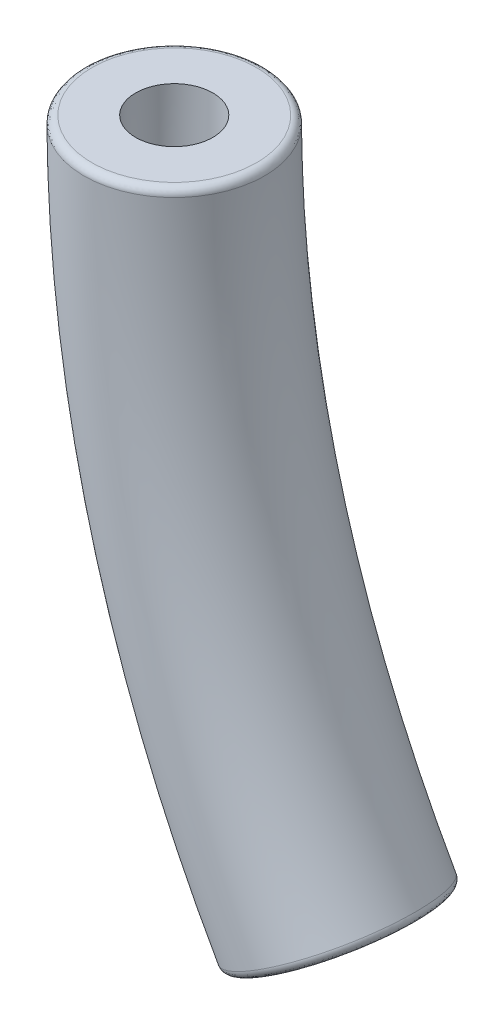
ISO-10303-21;
HEADER;
FILE_DESCRIPTION(('STEP AP214'),'2;1');
FILE_NAME('part.step','',(''),(''),'','','');
FILE_SCHEMA(('AUTOMOTIVE_DESIGN { 1 0 10303 214 1 1 1 1 }'));
ENDSEC;
DATA;
#1=APPLICATION_CONTEXT('core data for automotive mechanical design processes');
#2=APPLICATION_PROTOCOL_DEFINITION('international standard','automotive_design',2000,#1);
#3=PRODUCT_CONTEXT('',#1,'mechanical');
#4=PRODUCT('Part','Part','',(#3));
#5=PRODUCT_RELATED_PRODUCT_CATEGORY('part','',(#4));
#6=PRODUCT_DEFINITION_FORMATION('','',#4);
#7=PRODUCT_DEFINITION_CONTEXT('part definition',#1,'design');
#8=PRODUCT_DEFINITION('design','',#6,#7);
#9=PRODUCT_DEFINITION_SHAPE('','',#8);
#10=(LENGTH_UNIT() NAMED_UNIT(*) SI_UNIT(.MILLI.,.METRE.));
#11=(NAMED_UNIT(*) PLANE_ANGLE_UNIT() SI_UNIT($,.RADIAN.));
#12=(NAMED_UNIT(*) SI_UNIT($,.STERADIAN.) SOLID_ANGLE_UNIT());
#13=UNCERTAINTY_MEASURE_WITH_UNIT(LENGTH_MEASURE(1.E-05),#10,'distance_accuracy_value','');
#14=(GEOMETRIC_REPRESENTATION_CONTEXT(3) GLOBAL_UNCERTAINTY_ASSIGNED_CONTEXT((#13)) GLOBAL_UNIT_ASSIGNED_CONTEXT((#10,
#11,#12)) REPRESENTATION_CONTEXT('',''));
#15=CARTESIAN_POINT('',(0.,0.,0.));
#16=DIRECTION('',(0.,0.,1.));
#17=DIRECTION('',(1.,0.,0.));
#18=AXIS2_PLACEMENT_3D('',#15,#16,#17);
#19=CARTESIAN_POINT('',(0.,0.,0.));
#20=DIRECTION('',(0.,0.,-1.));
#21=DIRECTION('',(-1.,0.,0.));
#22=AXIS2_PLACEMENT_3D('',#19,#20,#21);
#23=TOROIDAL_SURFACE('',#22,482.,15.);
#24=CARTESIAN_POINT('',(-417.165975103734,-241.446783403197,0.));
#25=DIRECTION('',(0.500926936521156,-0.865489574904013,0.));
#26=DIRECTION('',(0.865489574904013,0.500926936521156,0.));
#27=AXIS2_PLACEMENT_3D('',#24,#25,#26);
#28=CIRCLE('',#27,15.);
#29=CARTESIAN_POINT('',(-430.148318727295,-248.960687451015,0.));
#30=VERTEX_POINT('',#29);
#31=EDGE_CURVE('E96',#30,#30,#28,.T.);
#32=CARTESIAN_POINT('',(-482.,0.,0.));
#33=DIRECTION('',(0.,-1.,0.));
#34=DIRECTION('',(1.,0.,0.));
#35=AXIS2_PLACEMENT_3D('',#32,#33,#34);
#36=CIRCLE('',#35,15.);
#37=CARTESIAN_POINT('',(-497.,0.,0.));
#38=VERTEX_POINT('',#37);
#39=EDGE_CURVE('E122',#38,#38,#36,.T.);
#40=CARTESIAN_POINT('',(0.,0.,0.));
#41=DIRECTION('',(0.,0.,-1.));
#42=DIRECTION('',(-1.,0.,0.));
#43=AXIS2_PLACEMENT_3D('',#40,#41,#42);
#44=CIRCLE('',#43,497.);
#45=EDGE_CURVE('',#30,#38,#44,.T.);
#46=ORIENTED_EDGE('',*,*,#31,.T.);
#47=ORIENTED_EDGE('',*,*,#39,.F.);
#48=ORIENTED_EDGE('',*,*,#45,.T.);
#49=ORIENTED_EDGE('',*,*,#45,.F.);
#50=EDGE_LOOP('',(#46,#48,#47,#49));
#51=FACE_BOUND('',#50,.T.);
#52=ADVANCED_FACE('F29',(#51),#23,.F.);
#53=CARTESIAN_POINT('',(0.,0.,0.));
#54=DIRECTION('',(0.,0.,-1.));
#55=DIRECTION('',(-1.,0.,0.));
#56=AXIS2_PLACEMENT_3D('',#53,#54,#55);
#57=TOROIDAL_SURFACE('',#56,482.,35.);
#58=CARTESIAN_POINT('',(-450.167138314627,0.,-3.36232520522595));
#59=CARTESIAN_POINT('',(-447.203451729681,0.,-3.67546794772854));
#60=CARTESIAN_POINT('',(-447.183810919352,-2.9801185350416,-3.67754319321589));
#61=CARTESIAN_POINT('',(-450.072609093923,0.,-2.46766936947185));
#62=CARTESIAN_POINT('',(-447.100182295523,0.,-2.69749400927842));
#63=CARTESIAN_POINT('',(-447.080420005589,-2.98005530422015,-2.69901337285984));
#64=CARTESIAN_POINT('',(-450.015831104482,0.,-1.56902475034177));
#65=CARTESIAN_POINT('',(-447.038153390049,0.,-1.71514919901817));
#66=CARTESIAN_POINT('',(-447.018319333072,-2.98001729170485,-1.71612082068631));
#67=CARTESIAN_POINT('',(-449.978181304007,0.,0.229853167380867));
#68=CARTESIAN_POINT('',(-446.997022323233,0.,0.251257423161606));
#69=CARTESIAN_POINT('',(-446.977140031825,-2.97999208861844,0.251401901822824));
#70=CARTESIAN_POINT('',(-449.997309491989,0.,1.13008646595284));
#71=CARTESIAN_POINT('',(-447.017919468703,0.,1.23533577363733));
#72=CARTESIAN_POINT('',(-446.998061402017,-2.98000489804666,1.23603207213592));
#73=CARTESIAN_POINT('',(-450.111336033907,0.,2.92574154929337));
#74=CARTESIAN_POINT('',(-447.142489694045,0.,3.19822579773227));
#75=CARTESIAN_POINT('',(-447.122777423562,-2.98008120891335,3.20002981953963));
#76=CARTESIAN_POINT('',(-450.206234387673,0.,3.82116333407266));
#77=CARTESIAN_POINT('',(-447.2461648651,0.,4.17705387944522));
#78=CARTESIAN_POINT('',(-447.226572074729,-2.9801447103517,4.17939739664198));
#79=CARTESIAN_POINT('',(-450.471126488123,0.,5.60082942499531));
#80=CARTESIAN_POINT('',(-447.535554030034,0.,6.1224972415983));
#81=CARTESIAN_POINT('',(-447.516296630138,-2.98032176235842,6.12590718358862));
#82=CARTESIAN_POINT('',(-450.641120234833,0.,6.48507373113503));
#83=CARTESIAN_POINT('',(-447.721272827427,0.,7.08912828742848));
#84=CARTESIAN_POINT('',(-447.702226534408,-2.9804353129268,7.09304939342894));
#85=CARTESIAN_POINT('',(-451.054993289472,0.,8.23609373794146));
#86=CARTESIAN_POINT('',(-448.173429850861,0.,9.0033128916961));
#87=CARTESIAN_POINT('',(-448.154898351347,-2.98071131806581,9.00822752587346));
#88=CARTESIAN_POINT('',(-451.298872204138,0.,9.10286953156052));
#89=CARTESIAN_POINT('',(-448.439874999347,0.,9.95088118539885));
#90=CARTESIAN_POINT('',(-448.421639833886,-2.98087377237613,9.95626355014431));
#91=CARTESIAN_POINT('',(-451.858781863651,0.,10.8127952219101));
#92=CARTESIAN_POINT('',(-449.051595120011,0.,11.8202210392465));
#93=CARTESIAN_POINT('',(-449.034038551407,-2.98124595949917,11.8264947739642));
#94=CARTESIAN_POINT('',(-452.174812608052,0.,11.6559451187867));
#95=CARTESIAN_POINT('',(-449.396879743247,0.,12.7420056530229));
#96=CARTESIAN_POINT('',(-449.379695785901,-2.98145569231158,12.748689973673));
#97=CARTESIAN_POINT('',(-452.876778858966,0.,13.3126248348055));
#98=CARTESIAN_POINT('',(-450.163830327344,0.,14.553235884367));
#99=CARTESIAN_POINT('',(-450.147468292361,-2.98192035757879,14.5606834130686));
#100=CARTESIAN_POINT('',(-453.262714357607,0.,14.1261546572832));
#101=CARTESIAN_POINT('',(-450.585507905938,0.,15.4426925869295));
#102=CARTESIAN_POINT('',(-450.569583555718,-2.98217529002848,15.4504816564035));
#103=CARTESIAN_POINT('',(-454.101746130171,0.,15.7178109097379));
#104=CARTESIAN_POINT('',(-451.502254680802,0.,17.1829535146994));
#105=CARTESIAN_POINT('',(-451.487270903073,-2.98272785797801,17.1913556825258));
#106=CARTESIAN_POINT('',(-454.554842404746,0.,16.4959373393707));
#107=CARTESIAN_POINT('',(-451.99733709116,0.,18.0337665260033));
#108=CARTESIAN_POINT('',(-451.982842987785,-2.98302549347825,18.0424314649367));
#109=CARTESIAN_POINT('',(-455.524978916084,0.,18.0112624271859));
#110=CARTESIAN_POINT('',(-453.057388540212,0.,19.690707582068));
#111=CARTESIAN_POINT('',(-453.04392560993,-2.98366059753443,19.6998182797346));
#112=CARTESIAN_POINT('',(-456.04201976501,0.,18.7484606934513));
#113=CARTESIAN_POINT('',(-453.622372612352,0.,20.4968414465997));
#114=CARTESIAN_POINT('',(-453.609436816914,-2.98399806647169,20.5061288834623));
#115=CARTESIAN_POINT('',(-457.136365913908,0.,20.1766807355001));
#116=CARTESIAN_POINT('',(-454.818217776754,0.,22.0586907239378));
#117=CARTESIAN_POINT('',(-454.806373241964,-2.98470963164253,22.0682445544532));
#118=CARTESIAN_POINT('',(-457.713671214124,0.,20.8677025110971));
#119=CARTESIAN_POINT('',(-455.44909391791,0.,22.8144096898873));
#120=CARTESIAN_POINT('',(-455.437798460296,-2.98508372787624,22.8240496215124));
#121=CARTESIAN_POINT('',(-458.924442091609,0.,22.1986575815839));
#122=CARTESIAN_POINT('',(-456.772250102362,0.,24.270061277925));
#123=CARTESIAN_POINT('',(-456.762073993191,-2.985865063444,24.2797817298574));
#124=CARTESIAN_POINT('',(-459.557907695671,0.,22.838590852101));
#125=CARTESIAN_POINT('',(-457.464545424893,0.,24.9699946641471));
#126=CARTESIAN_POINT('',(-457.454924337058,-2.98627230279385,24.9797087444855));
#127=CARTESIAN_POINT('',(-460.876495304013,0.,24.0628195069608));
#128=CARTESIAN_POINT('',(-458.905630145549,0.,26.3091009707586));
#129=CARTESIAN_POINT('',(-458.897124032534,-2.9871162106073,26.3187088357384));
#130=CARTESIAN_POINT('',(-461.561617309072,0.,24.6471148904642));
#131=CARTESIAN_POINT('',(-459.654434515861,0.,26.9482719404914));
#132=CARTESIAN_POINT('',(-459.646473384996,-2.98755287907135,26.9577819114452));
#133=CARTESIAN_POINT('',(-462.978661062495,0.,25.7559253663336));
#134=CARTESIAN_POINT('',(-461.20324160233,0.,28.1613216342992));
#135=CARTESIAN_POINT('',(-461.196359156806,-2.98845176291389,28.1705433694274));
#136=CARTESIAN_POINT('',(-463.710583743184,0.,26.2804392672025));
#137=CARTESIAN_POINT('',(-462.00325956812,0.,28.7351944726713));
#138=CARTESIAN_POINT('',(-461.996896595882,-2.98891397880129,28.7442304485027));
#139=CARTESIAN_POINT('',(-465.216012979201,0.,27.2659447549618));
#140=CARTESIAN_POINT('',(-463.648804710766,0.,29.8135512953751));
#141=CARTESIAN_POINT('',(-463.643453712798,-2.98985993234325,29.8221270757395));
#142=CARTESIAN_POINT('',(-465.989519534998,0.,27.7269363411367));
#143=CARTESIAN_POINT('',(-464.494344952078,0.,30.3180282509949));
#144=CARTESIAN_POINT('',(-464.489473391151,-2.99034366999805,30.3263366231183));
#145=CARTESIAN_POINT('',(-467.572616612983,0.,28.5821198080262));
#146=CARTESIAN_POINT('',(-466.22493383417,0.,31.2540023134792));
#147=CARTESIAN_POINT('',(-466.220979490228,-2.99132857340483,31.2616935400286));
#148=CARTESIAN_POINT('',(-468.382207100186,0.,28.9763117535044));
#149=CARTESIAN_POINT('',(-467.109993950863,0.,31.6854902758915));
#150=CARTESIAN_POINT('',(-467.106465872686,-2.99182973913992,31.6928409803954));
#151=CARTESIAN_POINT('',(-470.031717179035,0.,29.6950943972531));
#152=CARTESIAN_POINT('',(-468.913341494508,0.,32.4724134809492));
#153=CARTESIAN_POINT('',(-468.910611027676,-2.99284537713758,32.4790094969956));
#154=CARTESIAN_POINT('',(-470.871636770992,0.,30.0196850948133));
#155=CARTESIAN_POINT('',(-469.831638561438,0.,32.8278376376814));
#156=CARTESIAN_POINT('',(-469.829269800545,-2.9933598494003,32.8340305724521));
#157=CARTESIAN_POINT('',(-472.575850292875,0.,30.596963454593));
#158=CARTESIAN_POINT('',(-471.694958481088,0.,33.4601049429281));
#159=CARTESIAN_POINT('',(-471.693246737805,-2.99439800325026,33.4654287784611));
#160=CARTESIAN_POINT('',(-473.440144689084,0.,30.8496497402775));
#161=CARTESIAN_POINT('',(-472.639989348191,0.,33.7369339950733));
#162=CARTESIAN_POINT('',(-472.638565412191,-2.99492168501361,33.7418044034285));
#163=CARTESIAN_POINT('',(-475.186947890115,0.,31.2813147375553));
#164=CARTESIAN_POINT('',(-474.55004886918,0.,34.2100249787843));
#165=CARTESIAN_POINT('',(-474.549124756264,-2.99597419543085,34.2139379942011));
#166=CARTESIAN_POINT('',(-476.069456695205,0.,31.4602934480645));
#167=CARTESIAN_POINT('',(-475.515082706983,0.,34.4062732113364));
#168=CARTESIAN_POINT('',(-475.514365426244,-2.99650302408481,34.4096959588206));
#169=CARTESIAN_POINT('',(-477.84641638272,0.,31.7432712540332));
#170=CARTESIAN_POINT('',(-477.458294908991,0.,34.7167975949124));
#171=CARTESIAN_POINT('',(-477.457908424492,-2.99756186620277,34.7192029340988));
#172=CARTESIAN_POINT('',(-478.740867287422,0.,31.8472702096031));
#173=CARTESIAN_POINT('',(-478.436476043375,0.,34.8310592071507));
#174=CARTESIAN_POINT('',(-478.436210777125,-2.99809187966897,34.8329517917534));
#175=CARTESIAN_POINT('',(-480.535350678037,0.,31.9795486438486));
#176=CARTESIAN_POINT('',(-480.399030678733,0.,34.9767866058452));
#177=CARTESIAN_POINT('',(-480.398920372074,-2.99914924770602,34.9776313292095));
#178=CARTESIAN_POINT('',(-481.435383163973,0.,32.0078281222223));
#179=CARTESIAN_POINT('',(-481.383404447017,0.,35.0082377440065));
#180=CARTESIAN_POINT('',(-481.383327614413,-2.99967660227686,35.0085620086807));
#181=CARTESIAN_POINT('',(-483.234638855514,0.,31.9884664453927));
#182=CARTESIAN_POINT('',(-483.351356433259,0.,34.9881092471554));
#183=CARTESIAN_POINT('',(-483.351257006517,-3.00072496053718,34.9873851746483));
#184=CARTESIAN_POINT('',(-484.13386205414,0.,31.9408246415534));
#185=CARTESIAN_POINT('',(-484.334932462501,0.,34.9365144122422));
#186=CARTESIAN_POINT('',(-484.334779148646,-3.00124596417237,34.935276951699));
#187=CARTESIAN_POINT('',(-485.925098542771,0.,31.7699578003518));
#188=CARTESIAN_POINT('',(-486.294287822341,0.,34.7506480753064));
#189=CARTESIAN_POINT('',(-486.293937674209,-3.00227808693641,34.7483913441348));
#190=CARTESIAN_POINT('',(-486.817111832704,0.,31.6467327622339));
#191=CARTESIAN_POINT('',(-487.270062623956,0.,34.6163626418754));
#192=CARTESIAN_POINT('',(-487.269574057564,-3.00278920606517,34.6136139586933));
#193=CARTESIAN_POINT('',(-488.587588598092,0.,31.3255750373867));
#194=CARTESIAN_POINT('',(-489.206878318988,0.,34.2660582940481));
#195=CARTESIAN_POINT('',(-489.206026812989,-3.00379821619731,34.2623476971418));
#196=CARTESIAN_POINT('',(-489.466052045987,0.,31.1276421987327));
#197=CARTESIAN_POINT('',(-490.167912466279,0.,34.0500262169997));
#198=CARTESIAN_POINT('',(-490.166843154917,-3.0042961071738,34.0458586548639));
#199=CARTESIAN_POINT('',(-491.203181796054,0.,30.658475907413));
#200=CARTESIAN_POINT('',(-492.068408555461,0.,33.5377538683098));
#201=CARTESIAN_POINT('',(-492.066822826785,-3.00527551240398,33.532708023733));
#202=CARTESIAN_POINT('',(-492.061848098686,0.,30.3872424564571));
#203=CARTESIAN_POINT('',(-493.007861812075,0.,33.2415018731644));
#204=CARTESIAN_POINT('',(-493.00598615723,-3.00575702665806,33.23604643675));
#205=CARTESIAN_POINT('',(-493.753292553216,0.,29.7733980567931));
#206=CARTESIAN_POINT('',(-494.85852666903,0.,32.5708806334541));
#207=CARTESIAN_POINT('',(-494.855997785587,-3.00670074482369,32.5646541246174));
#208=CARTESIAN_POINT('',(-494.586070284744,0.,29.4307859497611));
#209=CARTESIAN_POINT('',(-495.769727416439,0.,32.196499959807));
#210=CARTESIAN_POINT('',(-495.766845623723,-3.00716294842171,32.1899221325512));
#211=CARTESIAN_POINT('',(-496.219802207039,0.,28.67662246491));
#212=CARTESIAN_POINT('',(-497.557386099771,0.,31.3722772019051));
#213=CARTESIAN_POINT('',(-497.553734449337,-3.00806530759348,31.3650558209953));
#214=CARTESIAN_POINT('',(-497.02075639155,0.,28.2650710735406));
#215=CARTESIAN_POINT('',(-498.433832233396,0.,30.9224267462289));
#216=CARTESIAN_POINT('',(-498.429775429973,-3.00850546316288,30.9149214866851));
#217=CARTESIAN_POINT('',(-498.585115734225,0.,27.3759722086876));
#218=CARTESIAN_POINT('',(-500.14570849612,0.,29.9504743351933));
#219=CARTESIAN_POINT('',(-500.140788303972,-3.00936119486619,29.9424696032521));
#220=CARTESIAN_POINT('',(-499.348522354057,0.,26.8984273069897));
#221=CARTESIAN_POINT('',(-500.981127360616,0.,29.4283688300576));
#222=CARTESIAN_POINT('',(-500.975761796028,-3.00977677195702,29.42015486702));
#223=CARTESIAN_POINT('',(-500.832391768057,0.,25.8807244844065));
#224=CARTESIAN_POINT('',(-502.605036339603,0.,28.3155993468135));
#225=CARTESIAN_POINT('',(-502.5987391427,-3.01058106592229,28.3070424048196));
#226=CARTESIAN_POINT('',(-501.552854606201,0.,25.3405666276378));
#227=CARTESIAN_POINT('',(-503.393512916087,0.,27.7249312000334));
#228=CARTESIAN_POINT('',(-503.386743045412,-3.01096978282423,27.7162447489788));
#229=CARTESIAN_POINT('',(-502.945631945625,0.,24.2015453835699));
#230=CARTESIAN_POINT('',(-504.917831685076,0.,26.4793051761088));
#231=CARTESIAN_POINT('',(-504.910088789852,-3.01171822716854,26.4704402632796));
#232=CARTESIAN_POINT('',(-503.617952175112,0.,23.6026890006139));
#233=CARTESIAN_POINT('',(-505.653666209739,0.,25.8243529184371));
#234=CARTESIAN_POINT('',(-505.645436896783,-3.01207795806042,25.8154410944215));
#235=CARTESIAN_POINT('',(-504.909762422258,0.,22.3504706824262));
#236=CARTESIAN_POINT('',(-507.067566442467,0.,24.4547495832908));
#237=CARTESIAN_POINT('',(-507.058350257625,-3.01276660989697,24.4458273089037));
#238=CARTESIAN_POINT('',(-505.529252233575,0.,21.6971085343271));
#239=CARTESIAN_POINT('',(-507.745617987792,0.,23.740098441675));
#240=CARTESIAN_POINT('',(-507.73591528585,-3.01309553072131,23.7312124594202));
#241=CARTESIAN_POINT('',(-506.711145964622,0.,20.3403512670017));
#242=CARTESIAN_POINT('',(-509.039283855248,0.,22.2559886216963));
#243=CARTESIAN_POINT('',(-509.028607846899,-3.01372097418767,22.2472591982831));
#244=CARTESIAN_POINT('',(-507.273535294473,0.,19.6369434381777));
#245=CARTESIAN_POINT('',(-509.654868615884,0.,21.4865183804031));
#246=CARTESIAN_POINT('',(-509.643719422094,-3.01401748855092,21.4779068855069));
#247=CARTESIAN_POINT('',(-508.337039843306,0.,18.1852565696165));
#248=CARTESIAN_POINT('',(-510.819006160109,0.,19.8984177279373));
#249=CARTESIAN_POINT('',(-510.806924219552,-3.01457655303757,19.8901243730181));
#250=CARTESIAN_POINT('',(-508.838156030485,0.,17.4369782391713));
#251=CARTESIAN_POINT('',(-511.36754711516,0.,19.079792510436));
#252=CARTESIAN_POINT('',(-511.355018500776,-3.01483910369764,19.0716949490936));
#253=CARTESIAN_POINT('',(-509.775780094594,0.,15.9005008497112));
#254=CARTESIAN_POINT('',(-512.393937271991,0.,17.3988002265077));
#255=CARTESIAN_POINT('',(-512.380541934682,-3.01532909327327,17.3911728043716));
#256=CARTESIAN_POINT('',(-510.212257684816,0.,15.1122833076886));
#257=CARTESIAN_POINT('',(-512.8717414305,0.,16.5364192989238));
#258=CARTESIAN_POINT('',(-512.857937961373,-3.01555651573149,16.5290598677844));
#259=CARTESIAN_POINT('',(-511.017218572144,0.,13.5018621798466));
#260=CARTESIAN_POINT('',(-513.752941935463,0.,14.774412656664));
#261=CARTESIAN_POINT('',(-513.738361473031,-3.01597502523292,14.7676617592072));
#262=CARTESIAN_POINT('',(-511.385701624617,0.,12.6796584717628));
#263=CARTESIAN_POINT('',(-514.15632743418,0.,13.8747949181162));
#264=CARTESIAN_POINT('',(-514.14138869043,-3.0161661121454,13.8683764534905));
#265=CARTESIAN_POINT('',(-512.051691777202,0.,11.0080014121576));
#266=CARTESIAN_POINT('',(-514.885417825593,0.,12.0456908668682));
#267=CARTESIAN_POINT('',(-514.869813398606,-3.01651087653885,12.0400015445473));
#268=CARTESIAN_POINT('',(-512.349274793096,0.,10.1585783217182));
#269=CARTESIAN_POINT('',(-515.211196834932,0.,11.1162472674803));
#270=CARTESIAN_POINT('',(-515.195293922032,-3.01666459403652,11.1109450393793));
#271=CARTESIAN_POINT('',(-512.871785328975,0.,8.43797426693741));
#272=CARTESIAN_POINT('',(-515.78322780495,0.,9.23350739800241));
#273=CARTESIAN_POINT('',(-515.766788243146,-3.01693414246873,9.2290343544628));
#274=CARTESIAN_POINT('',(-513.096731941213,0.,7.56679908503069));
#275=CARTESIAN_POINT('',(-516.029493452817,0.,8.28022830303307));
#276=CARTESIAN_POINT('',(-516.012822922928,-3.01704998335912,8.27618649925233));
#277=CARTESIAN_POINT('',(-513.519259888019,0.,5.58962086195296));
#278=CARTESIAN_POINT('',(-516.492076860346,0.,6.11666136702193));
#279=CARTESIAN_POINT('',(-516.474961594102,-3.01726738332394,6.11364781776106));
#280=CARTESIAN_POINT('',(-513.696104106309,0.,4.47912551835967));
#281=CARTESIAN_POINT('',(-516.685683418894,0.,4.90147712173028));
#282=CARTESIAN_POINT('',(-516.668384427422,-3.01735821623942,4.89904353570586));
#283=CARTESIAN_POINT('',(-513.93209266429,0.,2.24569841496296));
#284=CARTESIAN_POINT('',(-516.944046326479,0.,2.45745618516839));
#285=CARTESIAN_POINT('',(-516.926496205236,-3.01747938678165,2.45623264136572));
#286=CARTESIAN_POINT('',(-513.991237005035,0.,1.1227666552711));
#287=CARTESIAN_POINT('',(-517.008797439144,0.,1.22864400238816));
#288=CARTESIAN_POINT('',(-516.991185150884,-3.01750972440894,1.22802602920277));
#289=CARTESIAN_POINT('',(-513.991251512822,0.,-0.8990390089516));
#290=CARTESIAN_POINT('',(-517.008813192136,0.,-0.983818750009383));
#291=CARTESIAN_POINT('',(-516.991201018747,-3.01750973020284,-0.983323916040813));
#292=CARTESIAN_POINT('',(-513.953341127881,0.,-1.79797215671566));
#293=CARTESIAN_POINT('',(-516.967308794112,0.,-1.9675152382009));
#294=CARTESIAN_POINT('',(-516.94973664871,-3.01749028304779,-1.96653204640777));
#295=CARTESIAN_POINT('',(-513.801964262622,0.,-3.58974899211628));
#296=CARTESIAN_POINT('',(-516.801579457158,0.,-3.92824742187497));
#297=CARTESIAN_POINT('',(-516.784168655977,-3.01741257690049,-3.92628796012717));
#298=CARTESIAN_POINT('',(-513.688477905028,0.,-4.48259101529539));
#299=CARTESIAN_POINT('',(-516.677334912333,0.,-4.90526862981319));
#300=CARTESIAN_POINT('',(-516.66004329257,-3.01735430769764,-4.90283392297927));
#301=CARTESIAN_POINT('',(-513.38656504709,0.,-6.25648839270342));
#302=CARTESIAN_POINT('',(-516.346799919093,0.,-6.84640580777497));
#303=CARTESIAN_POINT('',(-516.329827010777,-3.01719912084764,-6.8430341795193));
#304=CARTESIAN_POINT('',(-513.198057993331,0.,-7.13753002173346));
#305=CARTESIAN_POINT('',(-516.140425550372,0.,-7.81049456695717));
#306=CARTESIAN_POINT('',(-516.123647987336,-3.01710216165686,-7.80667346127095));
#307=CARTESIAN_POINT('',(-512.74744987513,0.,-8.88058858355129));
#308=CARTESIAN_POINT('',(-515.647106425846,0.,-9.71783663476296));
#309=CARTESIAN_POINT('',(-515.6307967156,-3.0168700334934,-9.71314376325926));
#310=CARTESIAN_POINT('',(-512.485349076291,0.,-9.74260558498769));
#311=CARTESIAN_POINT('',(-515.360168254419,0.,-10.6610786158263));
#312=CARTESIAN_POINT('',(-515.344124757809,-3.01673486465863,-10.6559748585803));
#313=CARTESIAN_POINT('',(-511.88956304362,0.,-11.4410654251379));
#314=CARTESIAN_POINT('',(-514.707924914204,0.,-12.5195510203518));
#315=CARTESIAN_POINT('',(-514.692485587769,-3.01642700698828,-12.5136653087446));
#316=CARTESIAN_POINT('',(-511.555912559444,0.,-12.2775204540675));
#317=CARTESIAN_POINT('',(-514.342665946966,0.,-13.4347844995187));
#318=CARTESIAN_POINT('',(-514.327556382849,-3.01625433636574,-13.4285379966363));
#319=CARTESIAN_POINT('',(-510.819319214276,0.,-13.9193592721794));
#320=CARTESIAN_POINT('',(-513.536295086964,0.,-15.2312162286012));
#321=CARTESIAN_POINT('',(-513.521909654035,-3.01587222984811,-15.2242992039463));
#322=CARTESIAN_POINT('',(-510.416375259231,0.,-14.7247425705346));
#323=CARTESIAN_POINT('',(-513.095191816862,0.,-16.1124050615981));
#324=CARTESIAN_POINT('',(-513.081190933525,-3.01566279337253,-16.1051871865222));
#325=CARTESIAN_POINT('',(-509.544175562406,0.,-16.2984955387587));
#326=CARTESIAN_POINT('',(-512.14040143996,0.,-17.8342377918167));
#327=CARTESIAN_POINT('',(-512.127225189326,-3.01520819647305,-17.8264794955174));
#328=CARTESIAN_POINT('',(-509.074936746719,0.,-17.0668745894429));
#329=CARTESIAN_POINT('',(-511.626744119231,0.,-18.6748847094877));
#330=CARTESIAN_POINT('',(-511.613996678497,-3.0149630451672,-18.6668940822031));
#331=CARTESIAN_POINT('',(-508.073407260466,0.,-18.5613747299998));
#332=CARTESIAN_POINT('',(-510.530421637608,0.,-20.3098891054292));
#333=CARTESIAN_POINT('',(-510.518576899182,-3.01443815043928,-20.3015036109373));
#334=CARTESIAN_POINT('',(-507.541116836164,0.,-19.287495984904));
#335=CARTESIAN_POINT('',(-509.947769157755,0.,-21.1042413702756));
#336=CARTESIAN_POINT('',(-509.936385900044,-3.01415840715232,-21.0956987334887));
#337=CARTESIAN_POINT('',(-506.417202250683,0.,-20.6924028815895));
#338=CARTESIAN_POINT('',(-508.717534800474,0.,-22.641095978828));
#339=CARTESIAN_POINT('',(-508.707107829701,-3.01356565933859,-22.6323156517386));
#340=CARTESIAN_POINT('',(-505.825571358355,0.,-21.371183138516));
#341=CARTESIAN_POINT('',(-508.069958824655,0.,-23.3835890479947));
#342=CARTESIAN_POINT('',(-508.060013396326,-3.01325265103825,-23.3747315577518));
#343=CARTESIAN_POINT('',(-504.587231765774,0.,-22.6764928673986));
#344=CARTESIAN_POINT('',(-506.714545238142,0.,-24.8113444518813));
#345=CARTESIAN_POINT('',(-506.705583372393,-3.01259496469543,-24.8024140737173));
#346=CARTESIAN_POINT('',(-503.940523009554,0.,-23.3030222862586));
#347=CARTESIAN_POINT('',(-506.006721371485,0.,-25.4966054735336));
#348=CARTESIAN_POINT('',(-505.998247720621,-3.01225028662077,-25.4876806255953));
#349=CARTESIAN_POINT('',(-502.596599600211,0.,-24.4993992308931));
#350=CARTESIAN_POINT('',(-504.535825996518,0.,-26.8050475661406));
#351=CARTESIAN_POINT('',(-504.52833577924,-3.01153101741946,-26.7962179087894));
#352=CARTESIAN_POINT('',(-501.899382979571,0.,-25.0692445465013));
#353=CARTESIAN_POINT('',(-503.772766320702,0.,-27.4282271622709));
#354=CARTESIAN_POINT('',(-503.765757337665,-3.01115642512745,-27.4194862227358));
#355=CARTESIAN_POINT('',(-500.459423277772,0.,-26.1481744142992));
#356=CARTESIAN_POINT('',(-502.196859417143,0.,-28.6080446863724));
#357=CARTESIAN_POINT('',(-502.190806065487,-3.01037931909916,-28.5995657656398));
#358=CARTESIAN_POINT('',(-499.716680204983,0.,-26.6572589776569));
#359=CARTESIAN_POINT('',(-501.384026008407,0.,-29.1646857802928));
#360=CARTESIAN_POINT('',(-501.378433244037,-3.00997680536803,-29.1563770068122));
#361=CARTESIAN_POINT('',(-498.190949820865,0.,-27.6110474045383));
#362=CARTESIAN_POINT('',(-499.714362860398,0.,-30.2074688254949));
#363=CARTESIAN_POINT('',(-499.709670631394,-3.00914604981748,-30.1995830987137));
#364=CARTESIAN_POINT('',(-497.407962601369,0.,-28.0557514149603));
#365=CARTESIAN_POINT('',(-498.857546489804,0.,-30.693616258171));
#366=CARTESIAN_POINT('',(-498.853280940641,-3.00871780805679,-30.6859781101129));
#367=CARTESIAN_POINT('',(-495.807308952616,0.,-28.8776188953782));
#368=CARTESIAN_POINT('',(-497.106017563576,0.,-31.5919600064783));
#369=CARTESIAN_POINT('',(-497.10257132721,-3.00783800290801,-31.5848956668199));
#370=CARTESIAN_POINT('',(-494.989642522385,0.,-29.2547823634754));
#371=CARTESIAN_POINT('',(-496.211317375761,0.,-32.0041637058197));
#372=CARTESIAN_POINT('',(-496.208251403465,-3.00738643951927,-31.9974182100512));
#373=CARTESIAN_POINT('',(-493.325445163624,0.,-29.9388870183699));
#374=CARTESIAN_POINT('',(-494.39039329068,0.,-32.7516931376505));
#375=CARTESIAN_POINT('',(-494.388041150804,-3.00646261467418,-32.745657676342));
#376=CARTESIAN_POINT('',(-492.47891429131,0.,-30.2458283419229));
#377=CARTESIAN_POINT('',(-493.46418058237,0.,-33.0870283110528));
#378=CARTESIAN_POINT('',(-493.462150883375,-3.00599035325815,-33.0813747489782));
#379=CARTESIAN_POINT('',(-490.763004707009,0.,-30.7873078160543));
#380=CARTESIAN_POINT('',(-491.586823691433,0.,-33.678443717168));
#381=CARTESIAN_POINT('',(-491.585380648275,-3.00502796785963,-33.6736179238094));
#382=CARTESIAN_POINT('',(-489.893625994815,0.,-31.021845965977));
#383=CARTESIAN_POINT('',(-490.635689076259,0.,-33.9345349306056));
#384=CARTESIAN_POINT('',(-490.634500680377,-3.00453784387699,-33.9301440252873));
#385=CARTESIAN_POINT('',(-488.138184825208,0.,-31.4168556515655));
#386=CARTESIAN_POINT('',(-488.715240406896,0.,-34.3656532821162));
#387=CARTESIAN_POINT('',(-488.714493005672,-3.00354276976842,-34.3621858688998));
#388=CARTESIAN_POINT('',(-487.252122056,0.,-31.577325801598));
#389=CARTESIAN_POINT('',(-487.745933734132,0.,-34.540691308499));
#390=CARTESIAN_POINT('',(-487.745364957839,-3.0030378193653,-34.5377000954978));
#391=CARTESIAN_POINT('',(-485.469627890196,0.,-31.8230523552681));
#392=CARTESIAN_POINT('',(-485.79605640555,0.,-34.808460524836));
#393=CARTESIAN_POINT('',(-485.795768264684,-3.00201634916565,-34.8064635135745));
#394=CARTESIAN_POINT('',(-484.573196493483,0.,-31.9083087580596));
#395=CARTESIAN_POINT('',(-484.815491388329,0.,-34.9012052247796));
#396=CARTESIAN_POINT('',(-484.815299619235,-3.00149982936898,-34.8997127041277));
#397=CARTESIAN_POINT('',(-482.776339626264,0.,-32.0030017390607));
#398=CARTESIAN_POINT('',(-482.850075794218,0.,-35.003738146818));
#399=CARTESIAN_POINT('',(-482.84999387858,-3.00045866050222,-35.0032831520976));
#400=CARTESIAN_POINT('',(-481.875914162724,0.,-32.0124384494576));
#401=CARTESIAN_POINT('',(-481.865228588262,0.,-35.0135407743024));
#402=CARTESIAN_POINT('',(-481.865156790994,-2.9999340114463,-35.0136045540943));
#403=CARTESIAN_POINT('',(-480.077468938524,0.,-31.9554253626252));
#404=CARTESIAN_POINT('',(-479.898252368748,0.,-34.9501308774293));
#405=CARTESIAN_POINT('',(-479.89811389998,-2.9988801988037,-34.9512464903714));
#406=CARTESIAN_POINT('',(-479.179449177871,0.,-31.8889755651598));
#407=CARTESIAN_POINT('',(-478.91612431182,0.,-34.8769329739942));
#408=CARTESIAN_POINT('',(-478.91590809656,-2.99835103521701,-34.8785670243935));
#409=CARTESIAN_POINT('',(-477.392190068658,0.,-31.6806607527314));
#410=CARTESIAN_POINT('',(-476.961560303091,0.,-34.6480523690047));
#411=CARTESIAN_POINT('',(-476.961100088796,-2.99729196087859,-34.6507226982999));
#412=CARTESIAN_POINT('',(-476.502950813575,0.,-31.5387949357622));
#413=CARTESIAN_POINT('',(-475.989122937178,0.,-34.4923833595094));
#414=CARTESIAN_POINT('',(-475.988497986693,-2.99676205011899,-34.4955569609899));
#415=CARTESIAN_POINT('',(-474.739584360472,0.,-31.1806560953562));
#416=CARTESIAN_POINT('',(-474.060864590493,0.,-34.0996781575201));
#417=CARTESIAN_POINT('',(-474.059822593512,-2.99570539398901,-34.1038426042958));
#418=CARTESIAN_POINT('',(-473.865457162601,0.,-30.96438307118));
#419=CARTESIAN_POINT('',(-473.105039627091,0.,-33.8626560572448));
#420=CARTESIAN_POINT('',(-473.103749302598,-2.99517864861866,-33.8672939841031));
#421=CARTESIAN_POINT('',(-472.138528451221,0.,-30.4589669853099));
#422=CARTESIAN_POINT('',(-471.216798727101,0.,-33.3089408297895));
#423=CARTESIAN_POINT('',(-471.214927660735,-2.9941323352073,-33.3144951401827));
#424=CARTESIAN_POINT('',(-471.285726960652,0.,-30.1698238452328));
#425=CARTESIAN_POINT('',(-470.284376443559,0.,-32.9922608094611));
#426=CARTESIAN_POINT('',(-470.282179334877,-2.99361276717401,-32.9982448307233));
#427=CARTESIAN_POINT('',(-469.607513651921,0.,-29.5207231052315));
#428=CARTESIAN_POINT('',(-468.449567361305,0.,-32.2814922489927));
#429=CARTESIAN_POINT('',(-468.446640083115,-2.99258489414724,-32.2882908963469));
#430=CARTESIAN_POINT('',(-468.782101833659,0.,-29.1607655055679));
#431=CARTESIAN_POINT('',(-467.54717195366,0.,-31.8874155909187));
#432=CARTESIAN_POINT('',(-467.543849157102,-2.99207658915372,-31.8945872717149));
#433=CARTESIAN_POINT('',(-467.164537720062,0.,-28.372595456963));
#434=CARTESIAN_POINT('',(-465.778828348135,0.,-31.0246664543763));
#435=CARTESIAN_POINT('',(-465.774644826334,-2.99107536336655,-31.0325262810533));
#436=CARTESIAN_POINT('',(-466.372385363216,0.,-27.9443831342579));
#437=CARTESIAN_POINT('',(-464.912869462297,0.,-30.5560043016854));
#438=CARTESIAN_POINT('',(-464.908231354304,-2.99058244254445,-30.5641690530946));
#439=CARTESIAN_POINT('',(-464.82697051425,0.,-27.0227472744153));
#440=CARTESIAN_POINT('',(-463.223546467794,0.,-29.5474247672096));
#441=CARTESIAN_POINT('',(-463.2179400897,-2.98961609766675,-29.5561298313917));
#442=CARTESIAN_POINT('',(-464.073708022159,0.,-26.5293237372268));
#443=CARTESIAN_POINT('',(-462.40017001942,0.,-29.0075155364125));
#444=CARTESIAN_POINT('',(-462.394062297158,-2.98914267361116,-29.0164478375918));
#445=CARTESIAN_POINT('',(-462.611428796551,0.,-25.4807734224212));
#446=CARTESIAN_POINT('',(-460.801857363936,0.,-27.8602884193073));
#447=CARTESIAN_POINT('',(-460.794700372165,-2.98821938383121,-27.8695959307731));
#448=CARTESIAN_POINT('',(-461.902412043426,0.,-24.9256466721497));
#449=CARTESIAN_POINT('',(-460.026907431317,0.,-27.2529763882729));
#450=CARTESIAN_POINT('',(-460.019216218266,-2.98776951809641,-27.2624260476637));
#451=CARTESIAN_POINT('',(-460.533665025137,0.,-23.7576362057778));
#452=CARTESIAN_POINT('',(-458.530946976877,0.,-25.9752674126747));
#453=CARTESIAN_POINT('',(-458.522154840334,-2.98689730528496,-25.9849146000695));
#454=CARTESIAN_POINT('',(-459.87393475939,0.,-23.1447524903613));
#455=CARTESIAN_POINT('',(-457.809921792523,0.,-25.3048737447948));
#456=CARTESIAN_POINT('',(-457.800577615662,-2.98647495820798,-25.3145730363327));
#457=CARTESIAN_POINT('',(-458.608460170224,0.,-21.8655940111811));
#458=CARTESIAN_POINT('',(-456.426935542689,0.,-23.9057817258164));
#459=CARTESIAN_POINT('',(-456.416470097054,-2.98566159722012,-23.9154934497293));
#460=CARTESIAN_POINT('',(-458.002715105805,0.,-21.1993199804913));
#461=CARTESIAN_POINT('',(-455.764958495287,0.,-23.1770847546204));
#462=CARTESIAN_POINT('',(-455.75393899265,-2.98527058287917,-23.1867562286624));
#463=CARTESIAN_POINT('',(-456.849507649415,0.,-19.8181102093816));
#464=CARTESIAN_POINT('',(-454.504752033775,0.,-21.6665611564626));
#465=CARTESIAN_POINT('',(-454.49262323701,-2.98452348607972,-21.6760580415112));
#466=CARTESIAN_POINT('',(-456.302045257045,0.,-19.1031744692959));
#467=CARTESIAN_POINT('',(-453.906507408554,0.,-20.8847323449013));
#468=CARTESIAN_POINT('',(-453.893838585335,-2.98416740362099,-20.8940970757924));
#469=CARTESIAN_POINT('',(-455.269295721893,0.,-17.6297239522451));
#470=CARTESIAN_POINT('',(-452.778007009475,0.,-19.2735037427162));
#471=CARTESIAN_POINT('',(-452.76427321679,-2.98349352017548,-19.2825105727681));
#472=CARTESIAN_POINT('',(-454.7840085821,0.,-16.8712091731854));
#473=CARTESIAN_POINT('',(-452.247736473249,0.,-18.4440990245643));
#474=CARTESIAN_POINT('',(-452.233492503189,-2.98317571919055,-18.4528850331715));
#475=CARTESIAN_POINT('',(-453.879060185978,0.,-15.3159932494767));
#476=CARTESIAN_POINT('',(-451.258942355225,0.,-16.7436135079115));
#477=CARTESIAN_POINT('',(-451.243709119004,-2.98258144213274,-16.7518676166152));
#478=CARTESIAN_POINT('',(-453.459398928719,0.,-14.5192921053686));
#479=CARTESIAN_POINT('',(-450.800404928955,0.,-15.8725251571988));
#480=CARTESIAN_POINT('',(-450.784706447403,-2.98230496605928,-15.8804757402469));
#481=CARTESIAN_POINT('',(-452.688694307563,0.,-12.8933845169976));
#482=CARTESIAN_POINT('',(-449.958334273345,0.,-14.0948799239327));
#483=CARTESIAN_POINT('',(-449.941751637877,-2.98179603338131,-14.1021393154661));
#484=CARTESIAN_POINT('',(-452.33764952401,0.,-12.0641787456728));
#485=CARTESIAN_POINT('',(-449.574787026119,0.,-13.1883137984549));
#486=CARTESIAN_POINT('',(-449.557797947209,-2.98156357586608,-13.1951955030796));
#487=CARTESIAN_POINT('',(-451.706663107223,0.,-10.3791416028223));
#488=CARTESIAN_POINT('',(-448.885400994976,0.,-11.346135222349));
#489=CARTESIAN_POINT('',(-448.867659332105,-2.98114496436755,-11.3521861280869));
#490=CARTESIAN_POINT('',(-451.426721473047,0.,-9.52331023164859));
#491=CARTESIAN_POINT('',(-448.579551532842,0.,-10.4105106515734));
#492=CARTESIAN_POINT('',(-448.561474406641,-2.98095881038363,-10.4161205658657));
#493=CARTESIAN_POINT('',(-450.939931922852,0.,-7.79110657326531));
#494=CARTESIAN_POINT('',(-448.047725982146,0.,-8.51685922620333));
#495=CARTESIAN_POINT('',(-448.029050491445,-2.98063466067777,-8.52152281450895));
#496=CARTESIAN_POINT('',(-450.733083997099,0.,-6.91473428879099));
#497=CARTESIAN_POINT('',(-447.82174135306,0.,-7.55881847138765));
#498=CARTESIAN_POINT('',(-447.802811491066,-2.9804966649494,-7.56299062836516));
#499=CARTESIAN_POINT('',(-450.393952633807,0.,-5.14767937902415));
#500=CARTESIAN_POINT('',(-447.451243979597,0.,-5.62713626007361));
#501=CARTESIAN_POINT('',(-447.431888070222,-2.98027021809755,-5.63027432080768));
#502=CARTESIAN_POINT('',(-450.261669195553,0.,-4.25699675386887));
#503=CARTESIAN_POINT('',(-447.306725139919,0.,-4.65347954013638));
#504=CARTESIAN_POINT('',(-447.287203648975,-2.98018176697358,-4.65609019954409));
#505=CARTESIAN_POINT('',(-450.167138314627,0.,-3.36232520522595));
#506=CARTESIAN_POINT('',(-447.203451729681,0.,-3.67546794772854));
#507=CARTESIAN_POINT('',(-447.183810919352,-2.9801185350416,-3.67754319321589));
#508=(BOUNDED_SURFACE() B_SPLINE_SURFACE(3,2,((#58,#59,#60),(#61,#62,#63),(#64,#65,#66),(#67,
#68,#69),(#70,#71,#72),(#73,#74,#75),(#76,#77,#78),(#79,#80,#81),(#82,#83,#84),(#85,#86,#87),
(#88,#89,#90),(#91,#92,#93),(#94,#95,#96),(#97,#98,#99),(#100,#101,#102),(#103,#104,#105),(#106,
#107,#108),(#109,#110,#111),(#112,#113,#114),(#115,#116,#117),(#118,#119,#120),(#121,#122,#123),
(#124,#125,#126),(#127,#128,#129),(#130,#131,#132),(#133,#134,#135),(#136,#137,#138),(#139,#140,
#141),(#142,#143,#144),(#145,#146,#147),(#148,#149,#150),(#151,#152,#153),(#154,#155,#156),
(#157,#158,#159),(#160,#161,#162),(#163,#164,#165),(#166,#167,#168),(#169,#170,#171),(#172,#173,
#174),(#175,#176,#177),(#178,#179,#180),(#181,#182,#183),(#184,#185,#186),(#187,#188,#189),
(#190,#191,#192),(#193,#194,#195),(#196,#197,#198),(#199,#200,#201),(#202,#203,#204),(#205,#206,
#207),(#208,#209,#210),(#211,#212,#213),(#214,#215,#216),(#217,#218,#219),(#220,#221,#222),
(#223,#224,#225),(#226,#227,#228),(#229,#230,#231),(#232,#233,#234),(#235,#236,#237),(#238,#239,
#240),(#241,#242,#243),(#244,#245,#246),(#247,#248,#249),(#250,#251,#252),(#253,#254,#255),
(#256,#257,#258),(#259,#260,#261),(#262,#263,#264),(#265,#266,#267),(#268,#269,#270),(#271,#272,
#273),(#274,#275,#276),(#277,#278,#279),(#280,#281,#282),(#283,#284,#285),(#286,#287,#288),
(#289,#290,#291),(#292,#293,#294),(#295,#296,#297),(#298,#299,#300),(#301,#302,#303),(#304,#305,
#306),(#307,#308,#309),(#310,#311,#312),(#313,#314,#315),(#316,#317,#318),(#319,#320,#321),
(#322,#323,#324),(#325,#326,#327),(#328,#329,#330),(#331,#332,#333),(#334,#335,#336),(#337,#338,
#339),(#340,#341,#342),(#343,#344,#345),(#346,#347,#348),(#349,#350,#351),(#352,#353,#354),
(#355,#356,#357),(#358,#359,#360),(#361,#362,#363),(#364,#365,#366),(#367,#368,#369),(#370,#371,
#372),(#373,#374,#375),(#376,#377,#378),(#379,#380,#381),(#382,#383,#384),(#385,#386,#387),
(#388,#389,#390),(#391,#392,#393),(#394,#395,#396),(#397,#398,#399),(#400,#401,#402),(#403,#404,
#405),(#406,#407,#408),(#409,#410,#411),(#412,#413,#414),(#415,#416,#417),(#418,#419,#420),
(#421,#422,#423),(#424,#425,#426),(#427,#428,#429),(#430,#431,#432),(#433,#434,#435),(#436,#437,
#438),(#439,#440,#441),(#442,#443,#444),(#445,#446,#447),(#448,#449,#450),(#451,#452,#453),
(#454,#455,#456),(#457,#458,#459),(#460,#461,#462),(#463,#464,#465),(#466,#467,#468),(#469,#470,
#471),(#472,#473,#474),(#475,#476,#477),(#478,#479,#480),(#481,#482,#483),(#484,#485,#486),
(#487,#488,#489),(#490,#491,#492),(#493,#494,#495),(#496,#497,#498),(#499,#500,#501),(#502,#503,
#504),(#505,#506,#507)),.UNSPECIFIED.,.T.,.F.,.F.) B_SPLINE_SURFACE_WITH_KNOTS((4,2,2,2,2,2,2,2,
2,2,2,2,2,2,2,2,2,2,2,2,2,2,2,2,2,2,2,2,2,2,2,2,2,2,2,2,2,2,2,2,2,2,2,2,2,2,2,2,2,2,2,2,2,2,2,2,
2,2,2,2,2,2,2,2,2,2,2,2,2,2,2,2,2,2,4),(3,3),(0.,2.69810869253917,5.39621735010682,
8.09432600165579,10.7924346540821,13.4905289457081,16.1886232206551,18.8867171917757,
21.5848111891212,24.2829310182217,26.9810508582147,29.6791719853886,32.3772931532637,
35.0754680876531,37.7736430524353,40.4718154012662,43.1699877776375,45.8682118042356,
48.566435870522,51.2646649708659,53.9628940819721,56.6611462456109,59.3593984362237,
62.0576561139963,64.75591372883,67.4542151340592,70.1525170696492,72.8507138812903,
75.5489079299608,78.2467804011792,80.9446634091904,83.6432340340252,86.3417620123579,
89.0415504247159,91.7413485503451,94.4382427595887,97.1344275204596,100.501502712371,
103.868577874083,106.564714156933,109.261559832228,111.961309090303,114.661048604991,
117.359479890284,120.057953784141,122.755739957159,125.453515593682,128.151597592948,
130.849682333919,133.54787223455,136.24606163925,138.944244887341,141.642428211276,
144.340606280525,147.038784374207,149.737012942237,152.435241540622,155.133465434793,
157.831689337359,160.529941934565,163.228194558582,165.926450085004,168.624705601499,
171.322956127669,174.021206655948,176.719455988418,179.417705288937,182.115917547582,
184.814129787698,187.512342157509,190.210554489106,192.908710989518,195.606867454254,
198.305023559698,201.003179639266),(0.,1.),
.UNSPECIFIED.) GEOMETRIC_REPRESENTATION_ITEM() RATIONAL_B_SPLINE_SURFACE(((1.,0.709445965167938,
1.),(1.,0.709453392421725,1.),(1.,0.709457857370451,1.),(1.,0.709460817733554,1.),(1.,
0.709459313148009,1.),(1.,0.70945034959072,1.),(1.,0.709442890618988,1.),(1.,0.709422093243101,
1.),(1.,0.709408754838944,1.),(1.,0.70937633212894,1.),(1.,0.709357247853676,1.),(1.,
0.709313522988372,1.),(1.,0.709288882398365,1.),(1.,0.709234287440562,1.),(1.,0.709204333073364,
1.),(1.,0.709139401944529,1.),(1.,0.709104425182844,1.),(1.,0.709029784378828,1.),(1.,
0.708990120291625,1.),(1.,0.708906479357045,1.),(1.,0.708862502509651,1.),(1.,0.708770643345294,
1.),(1.,0.708722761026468,1.),(1.,0.708623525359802,1.),(1.,0.708572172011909,1.),(1.,
0.708466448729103,1.),(1.,0.708412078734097,1.),(1.,0.708300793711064,1.),(1.,0.708243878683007,
1.),(1.,0.708127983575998,1.),(1.,0.708069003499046,1.),(1.,0.707949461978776,1.),(1.,
0.707888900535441,1.),(1.,0.707766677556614,1.),(1.,0.707705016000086,1.),(1.,0.707581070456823,
1.),(1.,0.70751878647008,1.),(1.,0.707394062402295,1.),(1.,0.707331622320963,1.),(1.,
0.707207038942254,1.),(1.,0.707144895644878,1.),(1.,0.707021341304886,1.),(1.,0.70695993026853,
1.),(1.,0.706838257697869,1.),(1.,0.706777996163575,1.),(1.,0.70665901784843,1.),(1.,
0.706600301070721,1.),(1.,0.70648478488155,1.),(1.,0.706427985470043,1.),(1.,0.706316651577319,
1.),(1.,0.706262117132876,1.),(1.,0.70615563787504,1.),(1.,0.706103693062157,1.),(1.,
0.706002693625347,1.),(1.,0.7059536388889,1.),(1.,0.7058586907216,1.),(1.,0.705812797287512,1.),
(1.,0.705724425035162,1.),(1.,0.70568194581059,1.),(1.,0.705600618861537,1.),(1.,
0.705561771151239,1.),(1.,0.705487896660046,1.),(1.,0.705452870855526,1.),(1.,0.705386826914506,
1.),(1.,0.705355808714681,1.),(1.,0.705297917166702,1.),(1.,0.705271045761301,1.),(1.,
0.705221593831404,1.),(1.,0.705199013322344,1.),(1.,0.705158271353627,1.),(1.,0.705140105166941,
1.),(1.,0.705108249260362,1.),(1.,0.705094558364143,1.),(1.,0.705068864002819,1.),(1.,
0.705058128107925,1.),(1.,0.705043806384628,1.),(1.,0.70504022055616,1.),(1.,0.705040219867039,
1.),(1.,0.705042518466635,1.),(1.,0.705051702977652,1.),(1.,0.705058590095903,1.),(1.,
0.705076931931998,1.),(1.,0.705088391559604,1.),(1.,0.705115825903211,1.),(1.,0.705131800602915,
1.),(1.,0.705168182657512,1.),(1.,0.705188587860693,1.),(1.,0.705233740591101,1.),(1.,
0.705258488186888,1.),(1.,0.705312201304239,1.),(1.,0.705341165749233,1.),(1.,0.705403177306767,
1.),(1.,0.705436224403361,1.),(1.,0.705506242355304,1.),(1.,0.705543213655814,1.),(1.,
0.705620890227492,1.),(1.,0.705661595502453,1.),(1.,0.705746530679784,1.),(1.,0.705790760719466,
1.),(1.,0.70588250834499,1.),(1.,0.705930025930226,1.),(1.,0.706028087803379,1.),(1.,
0.706078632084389,1.),(1.,0.706182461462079,1.),(1.,0.706235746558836,1.),(1.,0.7063447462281,
1.),(1.,0.706400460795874,1.),(1.,0.706513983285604,1.),(1.,0.706571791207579,1.),(1.,
0.706689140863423,1.),(1.,0.706748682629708,1.),(1.,0.706869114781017,1.),(1.,0.706930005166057,
1.),(1.,0.707052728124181,1.),(1.,0.707114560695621,1.),(1.,0.70723874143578,1.),(1.,
0.707301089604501,1.),(1.,0.707425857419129,1.),(1.,0.707488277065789,1.),(1.,0.707612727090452,
1.),(1.,0.707674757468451,1.),(1.,0.707797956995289,1.),(1.,0.707859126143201,1.),(1.,
0.707980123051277,1.),(1.,0.708039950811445,1.),(1.,0.708157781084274,1.),(1.,0.70821578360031,
1.),(1.,0.708329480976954,1.),(1.,0.708385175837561,1.),(1.,0.708493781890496,1.),(1.,
0.708546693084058,1.),(1.,0.708649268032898,1.),(1.,0.708698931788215,1.),(1.,0.708794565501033,
1.),(1.,0.708840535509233,1.),(1.,0.708928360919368,1.),(1.,0.708970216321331,1.),(1.,
0.709049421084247,1.),(1.,0.709086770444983,1.),(1.,0.709156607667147,1.),(1.,0.709189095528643,
1.),(1.,0.709248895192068,1.),(1.,0.709276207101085,1.),(1.,0.709325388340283,1.),(1.,
0.709347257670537,1.),(1.,0.709385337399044,1.),(1.,0.709401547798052,1.),(1.,0.709428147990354,
1.),(1.,0.709438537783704,1.),(1.,0.709445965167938,1.))) REPRESENTATION_ITEM('') SURFACE());
#509=CARTESIAN_POINT('',(-447.183810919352,-2.9801185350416,-3.67754319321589));
#510=CARTESIAN_POINT('',(-447.080420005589,-2.98005530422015,-2.69901337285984));
#511=CARTESIAN_POINT('',(-447.018319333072,-2.98001729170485,-1.71612082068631));
#512=CARTESIAN_POINT('',(-446.977140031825,-2.97999208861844,0.251401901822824));
#513=CARTESIAN_POINT('',(-446.998061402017,-2.98000489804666,1.23603207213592));
#514=CARTESIAN_POINT('',(-447.122777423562,-2.98008120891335,3.20002981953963));
#515=CARTESIAN_POINT('',(-447.226572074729,-2.9801447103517,4.17939739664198));
#516=CARTESIAN_POINT('',(-447.516296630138,-2.98032176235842,6.12590718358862));
#517=CARTESIAN_POINT('',(-447.702226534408,-2.9804353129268,7.09304939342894));
#518=CARTESIAN_POINT('',(-448.154898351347,-2.98071131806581,9.00822752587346));
#519=CARTESIAN_POINT('',(-448.421639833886,-2.98087377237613,9.95626355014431));
#520=CARTESIAN_POINT('',(-449.034038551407,-2.98124595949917,11.8264947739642));
#521=CARTESIAN_POINT('',(-449.379695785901,-2.98145569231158,12.748689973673));
#522=CARTESIAN_POINT('',(-450.147468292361,-2.98192035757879,14.5606834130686));
#523=CARTESIAN_POINT('',(-450.569583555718,-2.98217529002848,15.4504816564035));
#524=CARTESIAN_POINT('',(-451.487270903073,-2.98272785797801,17.1913556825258));
#525=CARTESIAN_POINT('',(-451.982842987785,-2.98302549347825,18.0424314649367));
#526=CARTESIAN_POINT('',(-453.04392560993,-2.98366059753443,19.6998182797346));
#527=CARTESIAN_POINT('',(-453.609436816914,-2.98399806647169,20.5061288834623));
#528=CARTESIAN_POINT('',(-454.806373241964,-2.98470963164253,22.0682445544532));
#529=CARTESIAN_POINT('',(-455.437798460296,-2.98508372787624,22.8240496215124));
#530=CARTESIAN_POINT('',(-456.762073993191,-2.985865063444,24.2797817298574));
#531=CARTESIAN_POINT('',(-457.454924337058,-2.98627230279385,24.9797087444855));
#532=CARTESIAN_POINT('',(-458.897124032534,-2.9871162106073,26.3187088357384));
#533=CARTESIAN_POINT('',(-459.646473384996,-2.98755287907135,26.9577819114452));
#534=CARTESIAN_POINT('',(-461.196359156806,-2.98845176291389,28.1705433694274));
#535=CARTESIAN_POINT('',(-461.996896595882,-2.98891397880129,28.7442304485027));
#536=CARTESIAN_POINT('',(-463.643453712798,-2.98985993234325,29.8221270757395));
#537=CARTESIAN_POINT('',(-464.489473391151,-2.99034366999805,30.3263366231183));
#538=CARTESIAN_POINT('',(-466.220979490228,-2.99132857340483,31.2616935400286));
#539=CARTESIAN_POINT('',(-467.106465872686,-2.99182973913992,31.6928409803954));
#540=CARTESIAN_POINT('',(-468.910611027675,-2.99284537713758,32.4790094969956));
#541=CARTESIAN_POINT('',(-469.829269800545,-2.9933598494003,32.8340305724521));
#542=CARTESIAN_POINT('',(-471.693246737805,-2.99439800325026,33.4654287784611));
#543=CARTESIAN_POINT('',(-472.638565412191,-2.99492168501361,33.7418044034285));
#544=CARTESIAN_POINT('',(-474.549124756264,-2.99597419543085,34.2139379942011));
#545=CARTESIAN_POINT('',(-475.514365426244,-2.99650302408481,34.4096959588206));
#546=CARTESIAN_POINT('',(-477.457908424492,-2.99756186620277,34.7192029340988));
#547=CARTESIAN_POINT('',(-478.436210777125,-2.99809187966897,34.8329517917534));
#548=CARTESIAN_POINT('',(-480.398920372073,-2.99914924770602,34.9776313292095));
#549=CARTESIAN_POINT('',(-481.383327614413,-2.99967660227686,35.0085620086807));
#550=CARTESIAN_POINT('',(-483.351257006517,-3.00072496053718,34.9873851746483));
#551=CARTESIAN_POINT('',(-484.334779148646,-3.00124596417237,34.935276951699));
#552=CARTESIAN_POINT('',(-486.293937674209,-3.00227808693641,34.7483913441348));
#553=CARTESIAN_POINT('',(-487.269574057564,-3.00278920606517,34.6136139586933));
#554=CARTESIAN_POINT('',(-489.206026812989,-3.00379821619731,34.2623476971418));
#555=CARTESIAN_POINT('',(-490.166843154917,-3.0042961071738,34.0458586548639));
#556=CARTESIAN_POINT('',(-492.066822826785,-3.00527551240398,33.532708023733));
#557=CARTESIAN_POINT('',(-493.00598615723,-3.00575702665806,33.23604643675));
#558=CARTESIAN_POINT('',(-494.855997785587,-3.00670074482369,32.5646541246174));
#559=CARTESIAN_POINT('',(-495.766845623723,-3.00716294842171,32.1899221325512));
#560=CARTESIAN_POINT('',(-497.553734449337,-3.00806530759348,31.3650558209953));
#561=CARTESIAN_POINT('',(-498.429775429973,-3.00850546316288,30.9149214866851));
#562=CARTESIAN_POINT('',(-500.140788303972,-3.00936119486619,29.9424696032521));
#563=CARTESIAN_POINT('',(-500.975761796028,-3.00977677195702,29.42015486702));
#564=CARTESIAN_POINT('',(-502.5987391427,-3.01058106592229,28.3070424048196));
#565=CARTESIAN_POINT('',(-503.386743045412,-3.01096978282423,27.7162447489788));
#566=CARTESIAN_POINT('',(-504.910088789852,-3.01171822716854,26.4704402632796));
#567=CARTESIAN_POINT('',(-505.645436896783,-3.01207795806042,25.8154410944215));
#568=CARTESIAN_POINT('',(-507.058350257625,-3.01276660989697,24.4458273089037));
#569=CARTESIAN_POINT('',(-507.73591528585,-3.01309553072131,23.7312124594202));
#570=CARTESIAN_POINT('',(-509.028607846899,-3.01372097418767,22.2472591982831));
#571=CARTESIAN_POINT('',(-509.643719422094,-3.01401748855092,21.4779068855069));
#572=CARTESIAN_POINT('',(-510.806924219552,-3.01457655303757,19.8901243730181));
#573=CARTESIAN_POINT('',(-511.355018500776,-3.01483910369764,19.0716949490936));
#574=CARTESIAN_POINT('',(-512.380541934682,-3.01532909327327,17.3911728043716));
#575=CARTESIAN_POINT('',(-512.857937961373,-3.01555651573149,16.5290598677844));
#576=CARTESIAN_POINT('',(-513.738361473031,-3.01597502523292,14.7676617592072));
#577=CARTESIAN_POINT('',(-514.14138869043,-3.0161661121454,13.8683764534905));
#578=CARTESIAN_POINT('',(-514.869813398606,-3.01651087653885,12.0400015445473));
#579=CARTESIAN_POINT('',(-515.195293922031,-3.01666459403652,11.1109450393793));
#580=CARTESIAN_POINT('',(-515.766788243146,-3.01693414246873,9.2290343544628));
#581=CARTESIAN_POINT('',(-516.012822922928,-3.01704998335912,8.27618649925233));
#582=CARTESIAN_POINT('',(-516.474961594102,-3.01726738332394,6.11364781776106));
#583=CARTESIAN_POINT('',(-516.668384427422,-3.01735821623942,4.89904353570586));
#584=CARTESIAN_POINT('',(-516.926496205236,-3.01747938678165,2.45623264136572));
#585=CARTESIAN_POINT('',(-516.991185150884,-3.01750972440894,1.22802602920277));
#586=CARTESIAN_POINT('',(-516.991201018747,-3.01750973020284,-0.983323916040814));
#587=CARTESIAN_POINT('',(-516.94973664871,-3.01749028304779,-1.96653204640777));
#588=CARTESIAN_POINT('',(-516.784168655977,-3.01741257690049,-3.92628796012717));
#589=CARTESIAN_POINT('',(-516.66004329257,-3.01735430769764,-4.90283392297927));
#590=CARTESIAN_POINT('',(-516.329827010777,-3.01719912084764,-6.8430341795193));
#591=CARTESIAN_POINT('',(-516.123647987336,-3.01710216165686,-7.80667346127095));
#592=CARTESIAN_POINT('',(-515.6307967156,-3.0168700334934,-9.71314376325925));
#593=CARTESIAN_POINT('',(-515.344124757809,-3.01673486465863,-10.6559748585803));
#594=CARTESIAN_POINT('',(-514.692485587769,-3.01642700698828,-12.5136653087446));
#595=CARTESIAN_POINT('',(-514.327556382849,-3.01625433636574,-13.4285379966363));
#596=CARTESIAN_POINT('',(-513.521909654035,-3.01587222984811,-15.2242992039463));
#597=CARTESIAN_POINT('',(-513.081190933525,-3.01566279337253,-16.1051871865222));
#598=CARTESIAN_POINT('',(-512.127225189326,-3.01520819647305,-17.8264794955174));
#599=CARTESIAN_POINT('',(-511.613996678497,-3.0149630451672,-18.6668940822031));
#600=CARTESIAN_POINT('',(-510.518576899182,-3.01443815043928,-20.3015036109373));
#601=CARTESIAN_POINT('',(-509.936385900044,-3.01415840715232,-21.0956987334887));
#602=CARTESIAN_POINT('',(-508.707107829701,-3.01356565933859,-22.6323156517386));
#603=CARTESIAN_POINT('',(-508.060013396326,-3.01325265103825,-23.3747315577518));
#604=CARTESIAN_POINT('',(-506.705583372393,-3.01259496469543,-24.8024140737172));
#605=CARTESIAN_POINT('',(-505.998247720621,-3.01225028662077,-25.4876806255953));
#606=CARTESIAN_POINT('',(-504.52833577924,-3.01153101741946,-26.7962179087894));
#607=CARTESIAN_POINT('',(-503.765757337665,-3.01115642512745,-27.4194862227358));
#608=CARTESIAN_POINT('',(-502.190806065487,-3.01037931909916,-28.5995657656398));
#609=CARTESIAN_POINT('',(-501.378433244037,-3.00997680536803,-29.1563770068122));
#610=CARTESIAN_POINT('',(-499.709670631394,-3.00914604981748,-30.1995830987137));
#611=CARTESIAN_POINT('',(-498.853280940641,-3.00871780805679,-30.6859781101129));
#612=CARTESIAN_POINT('',(-497.10257132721,-3.00783800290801,-31.5848956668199));
#613=CARTESIAN_POINT('',(-496.208251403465,-3.00738643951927,-31.9974182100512));
#614=CARTESIAN_POINT('',(-494.388041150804,-3.00646261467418,-32.745657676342));
#615=CARTESIAN_POINT('',(-493.462150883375,-3.00599035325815,-33.0813747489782));
#616=CARTESIAN_POINT('',(-491.585380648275,-3.00502796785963,-33.6736179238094));
#617=CARTESIAN_POINT('',(-490.634500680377,-3.00453784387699,-33.9301440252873));
#618=CARTESIAN_POINT('',(-488.714493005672,-3.00354276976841,-34.3621858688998));
#619=CARTESIAN_POINT('',(-487.745364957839,-3.0030378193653,-34.5377000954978));
#620=CARTESIAN_POINT('',(-485.795768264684,-3.00201634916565,-34.8064635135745));
#621=CARTESIAN_POINT('',(-484.815299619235,-3.00149982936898,-34.8997127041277));
#622=CARTESIAN_POINT('',(-482.84999387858,-3.00045866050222,-35.0032831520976));
#623=CARTESIAN_POINT('',(-481.865156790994,-2.9999340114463,-35.0136045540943));
#624=CARTESIAN_POINT('',(-479.89811389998,-2.9988801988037,-34.9512464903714));
#625=CARTESIAN_POINT('',(-478.91590809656,-2.99835103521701,-34.8785670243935));
#626=CARTESIAN_POINT('',(-476.961100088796,-2.99729196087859,-34.6507226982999));
#627=CARTESIAN_POINT('',(-475.988497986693,-2.99676205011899,-34.4955569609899));
#628=CARTESIAN_POINT('',(-474.059822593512,-2.99570539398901,-34.1038426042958));
#629=CARTESIAN_POINT('',(-473.103749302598,-2.99517864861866,-33.8672939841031));
#630=CARTESIAN_POINT('',(-471.214927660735,-2.9941323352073,-33.3144951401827));
#631=CARTESIAN_POINT('',(-470.282179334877,-2.99361276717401,-32.9982448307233));
#632=CARTESIAN_POINT('',(-468.446640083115,-2.99258489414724,-32.2882908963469));
#633=CARTESIAN_POINT('',(-467.543849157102,-2.99207658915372,-31.8945872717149));
#634=CARTESIAN_POINT('',(-465.774644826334,-2.99107536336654,-31.0325262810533));
#635=CARTESIAN_POINT('',(-464.908231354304,-2.99058244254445,-30.5641690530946));
#636=CARTESIAN_POINT('',(-463.2179400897,-2.98961609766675,-29.5561298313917));
#637=CARTESIAN_POINT('',(-462.394062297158,-2.98914267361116,-29.0164478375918));
#638=CARTESIAN_POINT('',(-460.794700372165,-2.98821938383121,-27.8695959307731));
#639=CARTESIAN_POINT('',(-460.019216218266,-2.98776951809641,-27.2624260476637));
#640=CARTESIAN_POINT('',(-458.522154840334,-2.98689730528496,-25.9849146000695));
#641=CARTESIAN_POINT('',(-457.800577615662,-2.98647495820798,-25.3145730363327));
#642=CARTESIAN_POINT('',(-456.416470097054,-2.98566159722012,-23.9154934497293));
#643=CARTESIAN_POINT('',(-455.75393899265,-2.98527058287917,-23.1867562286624));
#644=CARTESIAN_POINT('',(-454.49262323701,-2.98452348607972,-21.6760580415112));
#645=CARTESIAN_POINT('',(-453.893838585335,-2.98416740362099,-20.8940970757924));
#646=CARTESIAN_POINT('',(-452.76427321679,-2.98349352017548,-19.2825105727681));
#647=CARTESIAN_POINT('',(-452.233492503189,-2.98317571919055,-18.4528850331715));
#648=CARTESIAN_POINT('',(-451.243709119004,-2.98258144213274,-16.7518676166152));
#649=CARTESIAN_POINT('',(-450.784706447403,-2.98230496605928,-15.8804757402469));
#650=CARTESIAN_POINT('',(-449.941751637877,-2.98179603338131,-14.1021393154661));
#651=CARTESIAN_POINT('',(-449.557797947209,-2.98156357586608,-13.1951955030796));
#652=CARTESIAN_POINT('',(-448.867659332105,-2.98114496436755,-11.3521861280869));
#653=CARTESIAN_POINT('',(-448.561474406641,-2.98095881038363,-10.4161205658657));
#654=CARTESIAN_POINT('',(-448.029050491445,-2.98063466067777,-8.52152281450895));
#655=CARTESIAN_POINT('',(-447.802811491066,-2.9804966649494,-7.56299062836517));
#656=CARTESIAN_POINT('',(-447.431888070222,-2.98027021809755,-5.63027432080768));
#657=CARTESIAN_POINT('',(-447.287203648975,-2.98018176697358,-4.65609019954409));
#658=CARTESIAN_POINT('',(-447.183810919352,-2.9801185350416,-3.67754319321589));
#659=B_SPLINE_CURVE_WITH_KNOTS('',3,(#509,#510,#511,#512,#513,#514,#515,#516,#517,#518,#519,
#520,#521,#522,#523,#524,#525,#526,#527,#528,#529,#530,#531,#532,#533,#534,#535,#536,#537,#538,
#539,#540,#541,#542,#543,#544,#545,#546,#547,#548,#549,#550,#551,#552,#553,#554,#555,#556,#557,
#558,#559,#560,#561,#562,#563,#564,#565,#566,#567,#568,#569,#570,#571,#572,#573,#574,#575,#576,
#577,#578,#579,#580,#581,#582,#583,#584,#585,#586,#587,#588,#589,#590,#591,#592,#593,#594,#595,
#596,#597,#598,#599,#600,#601,#602,#603,#604,#605,#606,#607,#608,#609,#610,#611,#612,#613,#614,
#615,#616,#617,#618,#619,#620,#621,#622,#623,#624,#625,#626,#627,#628,#629,#630,#631,#632,#633,
#634,#635,#636,#637,#638,#639,#640,#641,#642,#643,#644,#645,#646,#647,#648,#649,#650,#651,#652,
#653,#654,#655,#656,#657,#658),.UNSPECIFIED.,.T.,.F.,(4,2,2,2,2,2,2,2,2,2,2,2,2,2,2,2,2,2,2,2,2,
2,2,2,2,2,2,2,2,2,2,2,2,2,2,2,2,2,2,2,2,2,2,2,2,2,2,2,2,2,2,2,2,2,2,2,2,2,2,2,2,2,2,2,2,2,2,2,2,
2,2,2,2,2,4),(0.,2.69810869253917,5.39621735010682,8.09432600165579,10.7924346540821,
13.4905289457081,16.1886232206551,18.8867171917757,21.5848111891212,24.2829310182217,
26.9810508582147,29.6791719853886,32.3772931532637,35.0754680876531,37.7736430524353,
40.4718154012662,43.1699877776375,45.8682118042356,48.566435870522,51.2646649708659,
53.9628940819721,56.6611462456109,59.3593984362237,62.0576561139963,64.75591372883,
67.4542151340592,70.1525170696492,72.8507138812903,75.5489079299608,78.2467804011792,
80.9446634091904,83.6432340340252,86.3417620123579,89.0415504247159,91.7413485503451,
94.4382427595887,97.1344275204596,100.501502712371,103.868577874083,106.564714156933,
109.261559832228,111.961309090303,114.661048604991,117.359479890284,120.057953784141,
122.755739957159,125.453515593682,128.151597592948,130.849682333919,133.54787223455,
136.24606163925,138.944244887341,141.642428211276,144.340606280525,147.038784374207,
149.737012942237,152.435241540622,155.133465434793,157.831689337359,160.529941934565,
163.228194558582,165.926450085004,168.624705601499,171.322956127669,174.021206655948,
176.719455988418,179.417705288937,182.115917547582,184.814129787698,187.512342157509,
190.210554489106,192.908710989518,195.606867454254,198.305023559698,201.003179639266),.UNSPECIFIED.);
#660=CARTESIAN_POINT('',(-447.183810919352,-2.9801185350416,-3.67754319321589));
#661=VERTEX_POINT('',#660);
#662=EDGE_CURVE('E44',#661,#661,#659,.T.);
#663=ORIENTED_EDGE('',*,*,#662,.T.);
#664=EDGE_LOOP('',(#663));
#665=FACE_BOUND('',#664,.T.);
#666=CARTESIAN_POINT('',(-389.614965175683,-225.500845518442,3.362325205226));
#667=CARTESIAN_POINT('',(-387.049925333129,-224.016255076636,3.67546794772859));
#668=CARTESIAN_POINT('',(-388.525748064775,-221.42715494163,3.67754319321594));
#669=CARTESIAN_POINT('',(-389.53315112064,-225.453493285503,2.4676693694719));
#670=CARTESIAN_POINT('',(-386.960546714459,-223.964524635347,2.69749400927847));
#671=CARTESIAN_POINT('',(-388.436232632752,-221.375418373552,2.69901337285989));
#672=CARTESIAN_POINT('',(-389.484010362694,-225.42505166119,1.56902475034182));
#673=CARTESIAN_POINT('',(-386.906861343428,-223.933452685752,1.71514919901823));
#674=CARTESIAN_POINT('',(-388.382466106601,-221.344343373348,1.71612082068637));
#675=CARTESIAN_POINT('',(-389.451424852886,-225.406191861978,-0.229853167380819));
#676=CARTESIAN_POINT('',(-386.871262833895,-223.912849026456,-0.251257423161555));
#677=CARTESIAN_POINT('',(-388.346813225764,-221.323737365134,-0.251401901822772));
#678=CARTESIAN_POINT('',(-389.467980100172,-225.415773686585,-1.13008646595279));
#679=CARTESIAN_POINT('',(-386.889349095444,-223.923316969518,-1.23533577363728));
#680=CARTESIAN_POINT('',(-388.364926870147,-221.334206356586,-1.23603207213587));
#681=CARTESIAN_POINT('',(-389.566668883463,-225.47289265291,-2.92574154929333));
#682=CARTESIAN_POINT('',(-386.997163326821,-223.98571755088,-3.19822579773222));
#683=CARTESIAN_POINT('',(-388.472905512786,-221.396613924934,-3.20002981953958));
#684=CARTESIAN_POINT('',(-389.648802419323,-225.520429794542,-3.82116333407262));
#685=CARTESIAN_POINT('',(-387.086893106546,-224.037651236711,-4.17705387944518));
#686=CARTESIAN_POINT('',(-388.562770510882,-221.448552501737,-4.17939739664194));
#687=CARTESIAN_POINT('',(-389.878063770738,-225.65312138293,-5.60082942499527));
#688=CARTESIAN_POINT('',(-387.337356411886,-224.182614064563,-6.12249724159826));
#689=CARTESIAN_POINT('',(-388.813612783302,-221.593530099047,-6.12590718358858));
#690=CARTESIAN_POINT('',(-390.025191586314,-225.738275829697,-6.48507373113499));
#691=CARTESIAN_POINT('',(-387.498094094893,-224.275645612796,-7.08912828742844));
#692=CARTESIAN_POINT('',(-388.974590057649,-221.686569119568,-7.09304939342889));
#693=CARTESIAN_POINT('',(-390.383394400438,-225.945595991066,-8.23609373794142));
#694=CARTESIAN_POINT('',(-387.889431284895,-224.502143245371,-9.00331289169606));
#695=CARTESIAN_POINT('',(-389.366511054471,-221.913085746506,-9.00822752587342));
#696=CARTESIAN_POINT('',(-390.59446905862,-226.067761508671,-9.10286953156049));
#697=CARTESIAN_POINT('',(-388.120036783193,-224.635612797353,-9.95088118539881));
#698=CARTESIAN_POINT('',(-389.597454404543,-222.046563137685,-9.95626355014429));
#699=CARTESIAN_POINT('',(-391.079065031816,-226.34823533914,-10.8127952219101));
#700=CARTESIAN_POINT('',(-388.649474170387,-224.942039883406,-11.8202210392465));
#701=CARTESIAN_POINT('',(-390.127665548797,-222.353008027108,-11.8264947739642));
#702=CARTESIAN_POINT('',(-391.352586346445,-226.506543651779,-11.6559451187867));
#703=CARTESIAN_POINT('',(-388.948314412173,-225.115002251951,-12.7420056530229));
#704=CARTESIAN_POINT('',(-390.426933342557,-222.525975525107,-12.748689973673));
#705=CARTESIAN_POINT('',(-391.960130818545,-226.858177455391,-13.3126248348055));
#706=CARTESIAN_POINT('',(-389.612102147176,-225.499188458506,-14.5532358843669));
#707=CARTESIAN_POINT('',(-391.091665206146,-222.910171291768,-14.5606834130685));
#708=CARTESIAN_POINT('',(-392.294153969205,-227.05150294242,-14.1261546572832));
#709=CARTESIAN_POINT('',(-389.97705969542,-225.710418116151,-15.4426925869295));
#710=CARTESIAN_POINT('',(-391.45712926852,-223.121399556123,-15.4504816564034));
#711=CARTESIAN_POINT('',(-393.020327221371,-227.471796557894,-15.7178109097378));
#712=CARTESIAN_POINT('',(-390.77049447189,-226.169641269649,-17.1829535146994));
#713=CARTESIAN_POINT('',(-392.251654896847,-223.580615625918,-17.1913556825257));
#714=CARTESIAN_POINT('',(-393.412477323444,-227.698764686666,-16.4959373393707));
#715=CARTESIAN_POINT('',(-391.198983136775,-226.417641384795,-18.0337665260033));
#716=CARTESIAN_POINT('',(-392.680716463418,-223.828603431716,-18.0424314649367));
#717=CARTESIAN_POINT('',(-394.252120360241,-228.184732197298,-18.0112624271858));
#718=CARTESIAN_POINT('',(-392.11644661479,-226.948649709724,-19.6907075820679));
#719=CARTESIAN_POINT('',(-393.599390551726,-224.359578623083,-19.6998182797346));
#720=CARTESIAN_POINT('',(-394.699613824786,-228.443731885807,-18.7484606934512));
#721=CARTESIAN_POINT('',(-392.605434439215,-227.231665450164,-20.4968414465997));
#722=CARTESIAN_POINT('',(-394.089003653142,-224.642566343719,-20.5061288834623));
#723=CARTESIAN_POINT('',(-395.646759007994,-228.991919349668,-20.1766807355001));
#724=CARTESIAN_POINT('',(-393.640425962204,-227.830696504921,-22.0586907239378));
#725=CARTESIAN_POINT('',(-395.125296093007,-225.241528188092,-22.0682445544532));
#726=CARTESIAN_POINT('',(-396.146410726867,-229.281107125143,-20.867702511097));
#727=CARTESIAN_POINT('',(-394.18644268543,-228.146719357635,-22.8144096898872));
#728=CARTESIAN_POINT('',(-395.671975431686,-225.557502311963,-22.8240496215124));
#729=CARTESIAN_POINT('',(-397.194320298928,-229.88761487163,-22.1986575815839));
#730=CARTESIAN_POINT('',(-395.331620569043,-228.809523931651,-24.270061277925));
#731=CARTESIAN_POINT('',(-396.818513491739,-226.220191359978,-24.2797817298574));
#732=CARTESIAN_POINT('',(-397.742578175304,-230.204934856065,-22.838590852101));
#733=CARTESIAN_POINT('',(-395.930794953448,-229.156313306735,-24.9699946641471));
#734=CARTESIAN_POINT('',(-397.418372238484,-226.566906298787,-24.9797087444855));
#735=CARTESIAN_POINT('',(-398.883802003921,-230.865450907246,-24.0628195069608));
#736=CARTESIAN_POINT('',(-397.17803875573,-229.878191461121,-26.3091009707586));
#737=CARTESIAN_POINT('',(-398.667003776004,-227.288612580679,-26.3187088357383));
#738=CARTESIAN_POINT('',(-399.476767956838,-231.208646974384,-24.6471148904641));
#739=CARTESIAN_POINT('',(-397.826121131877,-230.253287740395,-26.9482719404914));
#740=CARTESIAN_POINT('',(-399.315776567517,-227.663603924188,-26.9577819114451));
#741=CARTESIAN_POINT('',(-400.703204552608,-231.918482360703,-25.7559253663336));
#742=CARTESIAN_POINT('',(-399.166597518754,-231.029126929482,-28.1613216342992));
#743=CARTESIAN_POINT('',(-400.657636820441,-228.439205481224,-28.1705433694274));
#744=CARTESIAN_POINT('',(-401.33667600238,-232.28512214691,-26.2804392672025));
#745=CARTESIAN_POINT('',(-399.859004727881,-231.429877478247,-28.7351944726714));
#746=CARTESIAN_POINT('',(-401.350725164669,-228.839816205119,-28.7442304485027));
#747=CARTESIAN_POINT('',(-402.639609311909,-233.039232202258,-27.2659447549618));
#748=CARTESIAN_POINT('',(-401.283206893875,-232.25417536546,-29.8135512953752));
#749=CARTESIAN_POINT('',(-402.776277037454,-229.663802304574,-29.8221270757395));
#750=CARTESIAN_POINT('',(-403.309071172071,-233.426702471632,-27.7269363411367));
#751=CARTESIAN_POINT('',(-402.015013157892,-232.677729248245,-30.3180282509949));
#752=CARTESIAN_POINT('',(-403.508740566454,-230.087177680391,-30.3263366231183));
#753=CARTESIAN_POINT('',(-404.679225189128,-234.219718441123,-28.5821198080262));
#754=CARTESIAN_POINT('',(-403.512819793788,-233.54462783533,-31.2540023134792));
#755=CARTESIAN_POINT('',(-405.007834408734,-230.953683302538,-31.2616935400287));
#756=CARTESIAN_POINT('',(-405.379917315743,-234.625264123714,-28.9763117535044));
#757=CARTESIAN_POINT('',(-404.278830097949,-233.987978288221,-31.6854902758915));
#758=CARTESIAN_POINT('',(-405.774464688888,-231.396813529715,-31.6928409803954));
#759=CARTESIAN_POINT('',(-406.807551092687,-235.451548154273,-29.6950943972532));
#760=CARTESIAN_POINT('',(-405.839608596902,-234.891323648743,-32.4724134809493));
#761=CARTESIAN_POINT('',(-407.336442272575,-232.299679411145,-32.4790094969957));
#762=CARTESIAN_POINT('',(-407.534492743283,-235.872286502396,-30.0196850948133));
#763=CARTESIAN_POINT('',(-406.634385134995,-235.351323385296,-32.8278376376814));
#764=CARTESIAN_POINT('',(-408.131789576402,-232.759415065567,-32.8340305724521));
#765=CARTESIAN_POINT('',(-409.009471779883,-236.725972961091,-30.596963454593));
#766=CARTESIAN_POINT('',(-408.247069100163,-236.284710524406,-33.4601049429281));
#767=CARTESIAN_POINT('',(-409.74556222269,-233.69223281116,-33.4654287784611));
#768=CARTESIAN_POINT('',(-409.75750956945,-237.158921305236,-30.8496497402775));
#769=CARTESIAN_POINT('',(-409.064983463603,-236.758101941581,-33.7369339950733));
#770=CARTESIAN_POINT('',(-410.563988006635,-234.16531515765,-33.7418044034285));
#771=CARTESIAN_POINT('',(-411.269349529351,-238.033942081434,-31.2813147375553));
#772=CARTESIAN_POINT('',(-410.718120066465,-237.714902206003,-34.2100249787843));
#773=CARTESIAN_POINT('',(-412.218084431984,-235.121454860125,-34.2139379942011));
#774=CARTESIAN_POINT('',(-412.033151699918,-238.47601451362,-31.4602934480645));
#775=CARTESIAN_POINT('',(-411.553346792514,-238.198313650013,-34.4062732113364));
#776=CARTESIAN_POINT('',(-413.053755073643,-235.604512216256,-34.4096959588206));
#777=CARTESIAN_POINT('',(-413.571091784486,-239.366141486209,-31.7432712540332));
#778=CARTESIAN_POINT('',(-413.235176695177,-239.171720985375,-34.7167975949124));
#779=CARTESIAN_POINT('',(-414.736401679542,-236.577168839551,-34.7192029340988));
#780=CARTESIAN_POINT('',(-414.345229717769,-239.81419603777,-31.8472702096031));
#781=CARTESIAN_POINT('',(-414.081782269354,-239.661718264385,-34.8310592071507));
#782=CARTESIAN_POINT('',(-415.583377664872,-237.066768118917,-34.8329517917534));
#783=CARTESIAN_POINT('',(-415.898336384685,-240.713101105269,-31.9795486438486));
#784=CARTESIAN_POINT('',(-415.780352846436,-240.64481474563,-34.9767866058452));
#785=CARTESIAN_POINT('',(-417.282612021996,-238.049027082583,-34.9776313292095));
#786=CARTESIAN_POINT('',(-416.677305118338,-241.163951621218,-32.0078281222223));
#787=CARTESIAN_POINT('',(-416.632318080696,-241.137914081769,-35.0082377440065));
#788=CARTESIAN_POINT('',(-418.134870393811,-238.541686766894,-35.0085620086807));
#789=CARTESIAN_POINT('',(-418.234542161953,-242.0652472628,-31.9884664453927));
#790=CARTESIAN_POINT('',(-418.3355600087,-242.123714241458,-34.9881092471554));
#791=CARTESIAN_POINT('',(-419.838617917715,-239.526568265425,-34.9873851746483));
#792=CARTESIAN_POINT('',(-419.012810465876,-242.515692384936,-31.9408246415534));
#793=CARTESIAN_POINT('',(-419.186834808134,-242.616413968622,-34.9365144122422));
#794=CARTESIAN_POINT('',(-420.69010706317,-240.018790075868,-34.935276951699));
#795=CARTESIAN_POINT('',(-420.563106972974,-243.412970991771,-31.7699578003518));
#796=CARTESIAN_POINT('',(-420.882636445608,-243.597907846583,-34.7506480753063));
#797=CARTESIAN_POINT('',(-422.386255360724,-240.999292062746,-34.7483913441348));
#798=CARTESIAN_POINT('',(-421.335135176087,-243.859804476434,-31.6467327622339));
#799=CARTESIAN_POINT('',(-421.72715936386,-244.08669972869,-34.6163626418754));
#800=CARTESIAN_POINT('',(-423.230914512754,-241.487572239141,-34.6136139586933));
#801=CARTESIAN_POINT('',(-422.867464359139,-244.746683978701,-31.3255750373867));
#802=CARTESIAN_POINT('',(-423.403453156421,-245.056902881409,-34.2660582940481));
#803=CARTESIAN_POINT('',(-424.907399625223,-242.456720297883,-34.2623476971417));
#804=CARTESIAN_POINT('',(-423.627765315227,-245.186729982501,-31.1276421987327));
#805=CARTESIAN_POINT('',(-424.235218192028,-245.538310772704,-34.0500262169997));
#806=CARTESIAN_POINT('',(-425.739225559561,-242.937588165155,-34.0458586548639));
#807=CARTESIAN_POINT('',(-425.131233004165,-246.056905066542,-30.658475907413));
#808=CARTESIAN_POINT('',(-425.880077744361,-246.490320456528,-33.5377538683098));
#809=CARTESIAN_POINT('',(-427.384128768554,-243.88849149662,-33.532708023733));
#810=CARTESIAN_POINT('',(-425.874399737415,-246.487034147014,-30.3872424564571));
#811=CARTESIAN_POINT('',(-426.693164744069,-246.960917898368,-33.2415018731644));
#812=CARTESIAN_POINT('',(-428.197206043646,-244.358526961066,-33.23604643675));
#813=CARTESIAN_POINT('',(-427.33832727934,-247.334324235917,-29.7733980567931));
#814=CARTESIAN_POINT('',(-428.294895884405,-247.88796577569,-32.5708806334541));
#815=CARTESIAN_POINT('',(-429.79884455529,-245.284430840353,-32.5646541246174));
#816=CARTESIAN_POINT('',(-428.05908772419,-247.751485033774,-29.4307859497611));
#817=CARTESIAN_POINT('',(-429.083530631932,-248.344410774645,-32.1964999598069));
#818=CARTESIAN_POINT('',(-430.587405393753,-245.740299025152,-32.1899221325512));
#819=CARTESIAN_POINT('',(-429.473065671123,-248.569865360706,-28.67662246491));
#820=CARTESIAN_POINT('',(-430.630730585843,-249.239897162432,-31.3722772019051));
#821=CARTESIAN_POINT('',(-432.134391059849,-246.634618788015,-31.3650558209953));
#822=CARTESIAN_POINT('',(-430.166283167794,-248.971084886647,-28.2650710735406));
#823=CARTESIAN_POINT('',(-431.38928557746,-249.678932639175,-30.9224267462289));
#824=CARTESIAN_POINT('',(-432.892815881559,-247.073070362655,-30.914921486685));
#825=CARTESIAN_POINT('',(-431.520219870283,-249.754714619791,-27.3759722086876));
#826=CARTESIAN_POINT('',(-432.870896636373,-250.536457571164,-29.9504743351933));
#827=CARTESIAN_POINT('',(-434.374108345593,-247.929422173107,-29.9424696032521));
#828=CARTESIAN_POINT('',(-432.18094034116,-250.137125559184,-26.8984273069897));
#829=CARTESIAN_POINT('',(-433.593942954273,-250.954941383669,-29.4283688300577));
#830=CARTESIAN_POINT('',(-435.096977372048,-248.34732320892,-29.4201548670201));
#831=CARTESIAN_POINT('',(-433.465213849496,-250.880435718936,-25.8807244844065));
#832=CARTESIAN_POINT('',(-434.999419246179,-251.768401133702,-28.3155993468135));
#833=CARTESIAN_POINT('',(-436.50205023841,-249.159620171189,-28.3070424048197));
#834=CARTESIAN_POINT('',(-434.088766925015,-251.241334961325,-25.3405666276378));
#835=CARTESIAN_POINT('',(-435.681837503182,-252.163370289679,-27.7249312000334));
#836=CARTESIAN_POINT('',(-437.184254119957,-249.554016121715,-27.7162447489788));
#837=CARTESIAN_POINT('',(-435.29420119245,-251.939014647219,-24.2015453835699));
#838=CARTESIAN_POINT('',(-437.001119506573,-252.92694262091,-26.4793051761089));
#839=CARTESIAN_POINT('',(-438.503068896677,-250.316453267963,-26.4704402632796));
#840=CARTESIAN_POINT('',(-435.876087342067,-252.275797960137,-23.602689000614));
#841=CARTESIAN_POINT('',(-437.637976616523,-253.295541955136,-25.8243529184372));
#842=CARTESIAN_POINT('',(-439.139685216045,-250.684497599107,-25.8154410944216));
#843=CARTESIAN_POINT('',(-436.994135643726,-252.922900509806,-22.3504706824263));
#844=CARTESIAN_POINT('',(-438.861692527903,-254.003802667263,-24.4547495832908));
#845=CARTESIAN_POINT('',(-440.362891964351,-251.391667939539,-24.4458273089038));
#846=CARTESIAN_POINT('',(-437.53029761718,-253.233219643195,-21.6971085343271));
#847=CARTESIAN_POINT('',(-439.448539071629,-254.343456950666,-23.7400984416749));
#848=CARTESIAN_POINT('',(-440.9494821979,-251.730793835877,-23.7312124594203));
#849=CARTESIAN_POINT('',(-438.553214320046,-253.825262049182,-20.3403512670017));
#850=CARTESIAN_POINT('',(-440.568193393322,-254.991489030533,-22.2559886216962));
#851=CARTESIAN_POINT('',(-442.068607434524,-252.377797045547,-22.2472591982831));
#852=CARTESIAN_POINT('',(-439.039956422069,-254.106978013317,-19.6369434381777));
#853=CARTESIAN_POINT('',(-441.100975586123,-255.299852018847,-21.4865183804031));
#854=CARTESIAN_POINT('',(-442.601128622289,-252.685666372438,-21.4779068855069));
#855=CARTESIAN_POINT('',(-439.960408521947,-254.63971608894,-18.1852565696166));
#856=CARTESIAN_POINT('',(-442.108524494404,-255.882999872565,-19.8984177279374));
#857=CARTESIAN_POINT('',(-443.608150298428,-253.26786312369,-19.8901243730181));
#858=CARTESIAN_POINT('',(-440.394119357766,-254.890738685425,-17.4369782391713));
#859=CARTESIAN_POINT('',(-442.583280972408,-256.157778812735,-19.0797925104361));
#860=CARTESIAN_POINT('',(-444.08265170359,-253.54219107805,-19.0716949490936));
#861=CARTESIAN_POINT('',(-441.205623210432,-255.360419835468,-15.9005008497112));
#862=CARTESIAN_POINT('',(-443.471610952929,-256.671925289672,-17.3988002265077));
#863=CARTESIAN_POINT('',(-444.970476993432,-254.055479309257,-17.3911728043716));
#864=CARTESIAN_POINT('',(-441.583390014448,-255.579063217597,-15.1122833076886));
#865=CARTESIAN_POINT('',(-443.885145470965,-256.911270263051,-16.5364192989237));
#866=CARTESIAN_POINT('',(-445.383772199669,-254.294423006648,-16.5290598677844));
#867=CARTESIAN_POINT('',(-442.280075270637,-255.982289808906,-13.5018621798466));
#868=CARTESIAN_POINT('',(-444.64781532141,-257.352687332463,-14.774412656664));
#869=CARTESIAN_POINT('',(-446.145979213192,-254.735088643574,-14.7676617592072));
#870=CARTESIAN_POINT('',(-442.59899351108,-256.166872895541,-12.6796584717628));
#871=CARTESIAN_POINT('',(-444.996941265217,-257.554753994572,-13.8747949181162));
#872=CARTESIAN_POINT('',(-446.494890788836,-254.93681044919,-13.8683764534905));
#873=CARTESIAN_POINT('',(-443.175401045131,-256.500485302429,-11.0080014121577));
#874=CARTESIAN_POINT('',(-445.627961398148,-257.91997501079,-12.0456908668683));
#875=CARTESIAN_POINT('',(-447.125507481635,-255.301399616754,-12.0400015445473));
#876=CARTESIAN_POINT('',(-443.432956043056,-256.649552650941,-10.1585783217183));
#877=CARTESIAN_POINT('',(-445.909919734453,-258.083166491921,-11.1162472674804));
#878=CARTESIAN_POINT('',(-447.40728448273,-255.464308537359,-11.1109450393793));
#879=CARTESIAN_POINT('',(-443.885183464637,-256.91129225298,-8.43797426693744));
#880=CARTESIAN_POINT('',(-446.405006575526,-258.369712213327,-9.23350739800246));
#881=CARTESIAN_POINT('',(-447.902041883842,-255.750352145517,-9.22903435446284));
#882=CARTESIAN_POINT('',(-444.079872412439,-257.023974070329,-7.56679908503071));
#883=CARTESIAN_POINT('',(-446.618146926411,-258.493073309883,-8.2802283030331));
#884=CARTESIAN_POINT('',(-448.11504036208,-255.873497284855,-8.27618649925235));
#885=CARTESIAN_POINT('',(-444.445565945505,-257.235629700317,-5.58962086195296));
#886=CARTESIAN_POINT('',(-447.018508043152,-258.724793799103,-6.11666136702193));
#887=CARTESIAN_POINT('',(-448.515125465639,-256.10480683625,-6.11364781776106));
#888=CARTESIAN_POINT('',(-444.598622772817,-257.324215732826,-4.47912551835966));
#889=CARTESIAN_POINT('',(-447.186072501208,-258.821776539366,-4.90147712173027));
#890=CARTESIAN_POINT('',(-448.682576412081,-256.201618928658,-4.89904353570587));
#891=CARTESIAN_POINT('',(-444.802868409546,-257.44242875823,-2.24569841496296));
#892=CARTESIAN_POINT('',(-447.409682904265,-258.951197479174,-2.45745618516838));
#893=CARTESIAN_POINT('',(-448.906030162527,-256.330809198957,-2.45623264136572));
#894=CARTESIAN_POINT('',(-444.854057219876,-257.472055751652,-1.1227666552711));
#895=CARTESIAN_POINT('',(-447.46572431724,-258.983633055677,-1.22864400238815));
#896=CARTESIAN_POINT('',(-448.962032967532,-256.363187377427,-1.22802602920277));
#897=CARTESIAN_POINT('',(-444.854069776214,-257.472063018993,0.899039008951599));
#898=CARTESIAN_POINT('',(-447.46573795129,-258.983640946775,0.983818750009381));
#899=CARTESIAN_POINT('',(-448.962046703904,-256.363195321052,0.98332391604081));
#900=CARTESIAN_POINT('',(-444.821258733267,-257.453072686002,1.79797215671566));
#901=CARTESIAN_POINT('',(-447.429816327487,-258.962850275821,1.9675152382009));
#902=CARTESIAN_POINT('',(-448.926149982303,-256.342441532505,1.96653204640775));
#903=CARTESIAN_POINT('',(-444.690243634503,-257.377243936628,3.58974899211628));
#904=CARTESIAN_POINT('',(-447.286379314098,-258.879831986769,3.92824742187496));
#905=CARTESIAN_POINT('',(-448.782813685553,-256.25957131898,3.92628796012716));
#906=CARTESIAN_POINT('',(-444.592022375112,-257.320395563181,4.48259101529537));
#907=CARTESIAN_POINT('',(-447.178846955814,-258.81759454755,4.90526862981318));
#908=CARTESIAN_POINT('',(-448.67535528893,-256.197444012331,4.90283392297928));
#909=CARTESIAN_POINT('',(-444.330719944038,-257.169159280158,6.25648839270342));
#910=CARTESIAN_POINT('',(-446.892772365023,-258.652020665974,6.84640580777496));
#911=CARTESIAN_POINT('',(-448.389478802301,-256.032164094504,6.84303417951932));
#912=CARTESIAN_POINT('',(-444.167569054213,-257.074731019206,7.13753002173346));
#913=CARTESIAN_POINT('',(-446.714157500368,-258.548642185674,7.81049456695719));
#914=CARTESIAN_POINT('',(-448.210984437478,-255.928967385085,7.80667346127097));
#915=CARTESIAN_POINT('',(-443.777572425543,-256.849009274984,8.88058858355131));
#916=CARTESIAN_POINT('',(-446.28719494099,-258.301525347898,9.71783663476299));
#917=CARTESIAN_POINT('',(-447.784310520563,-255.68228581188,9.71314376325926));
#918=CARTESIAN_POINT('',(-443.550726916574,-256.717715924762,9.7426055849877));
#919=CARTESIAN_POINT('',(-446.038852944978,-258.157790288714,10.6610786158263));
#920=CARTESIAN_POINT('',(-447.536131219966,-255.538801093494,10.6559748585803));
#921=CARTESIAN_POINT('',(-443.035080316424,-256.419270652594,11.4410654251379));
#922=CARTESIAN_POINT('',(-445.474343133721,-257.831064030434,12.5195510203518));
#923=CARTESIAN_POINT('',(-446.971990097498,-255.212643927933,12.5136653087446));
#924=CARTESIAN_POINT('',(-442.746309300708,-256.252136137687,12.2775204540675));
#925=CARTESIAN_POINT('',(-445.158215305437,-257.648095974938,13.4347844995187));
#926=CARTESIAN_POINT('',(-446.656061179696,-255.029990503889,13.4285379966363));
#927=CARTESIAN_POINT('',(-442.108795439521,-255.88315668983,13.9193592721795));
#928=CARTESIAN_POINT('',(-444.460309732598,-257.244163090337,15.2312162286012));
#929=CARTESIAN_POINT('',(-445.958590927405,-254.626751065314,15.2242992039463));
#930=CARTESIAN_POINT('',(-441.760051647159,-255.681311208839,14.7247425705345));
#931=CARTESIAN_POINT('',(-444.078539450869,-257.023202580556,16.1124050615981));
#932=CARTESIAN_POINT('',(-445.577048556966,-254.406164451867,16.1051871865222));
#933=CARTESIAN_POINT('',(-441.005171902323,-255.244402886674,16.2984955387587));
#934=CARTESIAN_POINT('',(-443.252178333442,-256.544922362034,17.8342377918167));
#935=CARTESIAN_POINT('',(-444.751173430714,-253.928690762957,17.8264794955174));
#936=CARTESIAN_POINT('',(-440.599050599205,-255.009348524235,17.0668745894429));
#937=CARTESIAN_POINT('',(-442.807613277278,-256.28761757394,18.6748847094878));
#938=CARTESIAN_POINT('',(-444.306856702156,-253.671812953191,18.6668940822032));
#939=CARTESIAN_POINT('',(-439.732237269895,-254.507655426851,18.5613747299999));
#940=CARTESIAN_POINT('',(-441.8587575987,-255.738440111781,20.3098891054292));
#941=CARTESIAN_POINT('',(-443.358519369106,-253.123541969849,20.3015036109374));
#942=CARTESIAN_POINT('',(-439.27154545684,-254.241016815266,19.287495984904));
#943=CARTESIAN_POINT('',(-441.354477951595,-255.446573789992,21.1042413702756));
#944=CARTESIAN_POINT('',(-442.854498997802,-252.832148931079,21.0956987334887));
#945=CARTESIAN_POINT('',(-438.298809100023,-253.678017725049,20.6924028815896));
#946=CARTESIAN_POINT('',(-440.28972294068,-254.830316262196,22.641095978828));
#947=CARTESIAN_POINT('',(-441.790274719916,-252.216883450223,22.6323156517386));
#948=CARTESIAN_POINT('',(-437.786758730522,-253.381653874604,21.371183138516));
#949=CARTESIAN_POINT('',(-439.72925268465,-254.505928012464,23.3835890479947));
#950=CARTESIAN_POINT('',(-441.230064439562,-251.893007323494,23.3747315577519));
#951=CARTESIAN_POINT('',(-436.714988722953,-252.76133621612,22.6764928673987));
#952=CARTESIAN_POINT('',(-438.556156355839,-253.826964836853,24.8113444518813));
#953=CARTESIAN_POINT('',(-440.057489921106,-251.215106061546,24.8024140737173));
#954=CARTESIAN_POINT('',(-436.155269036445,-252.437382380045,23.3030222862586));
#955=CARTESIAN_POINT('',(-437.94354217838,-253.472396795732,25.4966054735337));
#956=CARTESIAN_POINT('',(-439.445125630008,-250.861080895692,25.4876806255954));
#957=CARTESIAN_POINT('',(-434.992117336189,-251.764174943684,24.4993992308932));
#958=CARTESIAN_POINT('',(-436.670497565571,-252.735585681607,26.8050475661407));
#959=CARTESIAN_POINT('',(-438.172571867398,-250.125384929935,26.7962179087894));
#960=CARTESIAN_POINT('',(-434.388683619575,-251.414920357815,25.0692445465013));
#961=CARTESIAN_POINT('',(-436.010077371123,-252.353348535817,27.4282271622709));
#962=CARTESIAN_POINT('',(-437.512380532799,-249.743713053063,27.4194862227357));
#963=CARTESIAN_POINT('',(-433.142413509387,-250.693605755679,26.1481744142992));
#964=CARTESIAN_POINT('',(-434.646146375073,-251.563934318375,28.6080446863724));
#965=CARTESIAN_POINT('',(-436.148887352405,-248.955450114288,28.5995657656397));
#966=CARTESIAN_POINT('',(-432.499577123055,-250.321545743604,26.6572589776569));
#967=CARTESIAN_POINT('',(-433.942647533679,-251.156764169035,29.1646857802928));
#968=CARTESIAN_POINT('',(-435.445585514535,-248.548859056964,29.1563770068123));
#969=CARTESIAN_POINT('',(-431.179073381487,-249.557266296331,27.6110474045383));
#970=CARTESIAN_POINT('',(-432.497571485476,-250.320384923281,30.2074688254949));
#971=CARTESIAN_POINT('',(-434.00087272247,-247.7136499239,30.1995830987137));
#972=CARTESIAN_POINT('',(-430.50140610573,-249.165046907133,28.0557514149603));
#973=CARTESIAN_POINT('',(-431.75600584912,-249.891182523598,30.6936162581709));
#974=CARTESIAN_POINT('',(-433.259461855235,-247.285031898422,30.6859781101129));
#975=CARTESIAN_POINT('',(-429.116057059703,-248.363236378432,28.8776188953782));
#976=CARTESIAN_POINT('',(-430.240075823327,-249.013794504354,31.5919600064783));
#977=CARTESIAN_POINT('',(-431.743800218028,-246.408815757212,31.5848956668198));
#978=CARTESIAN_POINT('',(-428.408375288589,-247.953645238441,29.2547823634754));
#979=CARTESIAN_POINT('',(-429.465722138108,-248.565615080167,32.0041637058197));
#980=CARTESIAN_POINT('',(-430.969549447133,-245.961217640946,31.9974182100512));
#981=CARTESIAN_POINT('',(-426.968029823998,-247.12000395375,29.9388870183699));
#982=CARTESIAN_POINT('',(-427.889731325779,-247.65346515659,32.7516931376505));
#983=CARTESIAN_POINT('',(-429.393713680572,-245.050224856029,32.745657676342));
#984=CARTESIAN_POINT('',(-426.235366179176,-246.695953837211,30.2458283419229));
#985=CARTESIAN_POINT('',(-427.088103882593,-247.189500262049,33.0870283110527));
#986=CARTESIAN_POINT('',(-428.592128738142,-244.586830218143,33.0813747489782));
#987=CARTESIAN_POINT('',(-424.750264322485,-245.8364085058,30.7873078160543));
#988=CARTESIAN_POINT('',(-425.463271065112,-246.249081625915,33.678443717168));
#989=CARTESIAN_POINT('',(-426.967321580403,-243.647538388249,33.6736179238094));
#990=CARTESIAN_POINT('',(-423.997826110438,-245.400913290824,31.021845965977));
#991=CARTESIAN_POINT('',(-424.640073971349,-245.772632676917,33.9345349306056));
#992=CARTESIAN_POINT('',(-426.144099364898,-243.171641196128,33.9301440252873));
#993=CARTESIAN_POINT('',(-422.478510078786,-244.521565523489,31.4168556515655));
#994=CARTESIAN_POINT('',(-422.977945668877,-244.810628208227,34.3656532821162));
#995=CARTESIAN_POINT('',(-424.481854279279,-242.210718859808,34.3621858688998));
#996=CARTESIAN_POINT('',(-421.711631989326,-244.077712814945,31.577325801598));
#997=CARTESIAN_POINT('',(-422.139020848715,-244.32507638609,34.5406913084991));
#998=CARTESIAN_POINT('',(-423.642831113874,-241.72569354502,34.5377000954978));
#999=CARTESIAN_POINT('',(-420.168901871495,-243.184813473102,31.8230523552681));
#1000=CARTESIAN_POINT('',(-420.451422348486,-243.348330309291,34.808460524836));
#1001=CARTESIAN_POINT('',(-421.954963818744,-240.749972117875,34.8064635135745));
#1002=CARTESIAN_POINT('',(-419.393049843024,-242.735766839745,31.9083087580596));
#1003=CARTESIAN_POINT('',(-419.602753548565,-242.857138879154,34.9012052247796));
#1004=CARTESIAN_POINT('',(-421.106119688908,-240.259276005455,34.8997127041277));
#1005=CARTESIAN_POINT('',(-417.837888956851,-241.835672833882,32.0030017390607));
#1006=CARTESIAN_POINT('',(-417.901706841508,-241.872609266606,35.003738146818));
#1007=CARTESIAN_POINT('',(-419.404646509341,-239.275702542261,35.0032831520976));
#1008=CARTESIAN_POINT('',(-417.058580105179,-241.384625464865,32.0124384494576));
#1009=CARTESIAN_POINT('',(-417.04933185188,-241.379272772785,35.0135407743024));
#1010=CARTESIAN_POINT('',(-418.552017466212,-238.782825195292,35.0136045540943));
#1011=CARTESIAN_POINT('',(-415.502044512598,-240.483735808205,31.9554253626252));
#1012=CARTESIAN_POINT('',(-415.346934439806,-240.393961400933,34.9501308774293));
#1013=CARTESIAN_POINT('',(-416.849034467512,-237.798392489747,34.9512464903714));
#1014=CARTESIAN_POINT('',(-414.724817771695,-240.033893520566,31.8889755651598));
#1015=CARTESIAN_POINT('',(-414.496912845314,-239.901987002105,34.8769329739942));
#1016=CARTESIAN_POINT('',(-415.998680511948,-237.306837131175,34.8785670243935));
#1017=CARTESIAN_POINT('',(-413.177963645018,-239.138607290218,31.6806607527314));
#1018=CARTESIAN_POINT('',(-412.805258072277,-238.922893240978,34.6480523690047));
#1019=CARTESIAN_POINT('',(-414.306284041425,-236.328537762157,34.6507226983));
#1020=CARTESIAN_POINT('',(-412.408336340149,-238.693163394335,31.5387949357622));
#1021=CARTESIAN_POINT('',(-411.963623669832,-238.435773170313,34.4923833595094));
#1022=CARTESIAN_POINT('',(-413.464241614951,-235.841793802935,34.4955569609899));
#1023=CARTESIAN_POINT('',(-410.882161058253,-237.809845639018,31.1806560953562));
#1024=CARTESIAN_POINT('',(-410.294736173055,-237.469856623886,34.0996781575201));
#1025=CARTESIAN_POINT('',(-411.794463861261,-234.876582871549,34.1038426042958));
#1026=CARTESIAN_POINT('',(-410.125613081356,-237.371971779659,30.96438307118));
#1027=CARTESIAN_POINT('',(-409.467479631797,-236.991058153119,33.8626560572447));
#1028=CARTESIAN_POINT('',(-410.966728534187,-234.398115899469,33.8672939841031));
#1029=CARTESIAN_POINT('',(-408.630974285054,-236.506906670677,30.4589669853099));
#1030=CARTESIAN_POINT('',(-407.833226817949,-236.045187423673,33.3089408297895));
#1031=CARTESIAN_POINT('',(-409.331448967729,-233.452859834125,33.3144951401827));
#1032=CARTESIAN_POINT('',(-407.892883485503,-236.079715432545,30.1698238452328));
#1033=CARTESIAN_POINT('',(-407.026225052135,-235.578111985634,32.9922608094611));
#1034=CARTESIAN_POINT('',(-408.523904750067,-232.986070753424,32.9982448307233));
#1035=CARTESIAN_POINT('',(-406.440407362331,-235.239053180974,29.5207231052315));
#1036=CARTESIAN_POINT('',(-405.438216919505,-234.65900669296,32.2814922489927));
#1037=CARTESIAN_POINT('',(-406.934749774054,-232.067489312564,32.2882908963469));
#1038=CARTESIAN_POINT('',(-405.726022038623,-234.825582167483,29.1607655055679));
#1039=CARTESIAN_POINT('',(-404.657203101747,-234.206972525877,31.8874155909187));
#1040=CARTESIAN_POINT('',(-406.153139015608,-231.61569695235,31.8945872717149));
#1041=CARTESIAN_POINT('',(-404.326037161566,-234.015300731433,28.372595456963));
#1042=CARTESIAN_POINT('',(-403.126720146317,-233.321161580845,31.0246664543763));
#1043=CARTESIAN_POINT('',(-404.621409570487,-230.730321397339,31.0325262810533));
#1044=CARTESIAN_POINT('',(-403.640437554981,-233.61849027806,27.9443831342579));
#1045=CARTESIAN_POINT('',(-402.377241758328,-232.887379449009,30.5560043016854));
#1046=CARTESIAN_POINT('',(-403.871290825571,-230.296738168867,30.5641690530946));
#1047=CARTESIAN_POINT('',(-402.302897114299,-232.844350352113,27.0227472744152));
#1048=CARTESIAN_POINT('',(-400.91515031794,-232.041152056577,29.5474247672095));
#1049=CARTESIAN_POINT('',(-402.407877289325,-229.450862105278,29.5561298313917));
#1050=CARTESIAN_POINT('',(-401.650956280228,-232.467020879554,26.5293237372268));
#1051=CARTESIAN_POINT('',(-400.202526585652,-231.62870061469,29.0075155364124));
#1052=CARTESIAN_POINT('',(-401.694582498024,-229.038569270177,29.0164478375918));
#1053=CARTESIAN_POINT('',(-400.385368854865,-231.734525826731,25.4807734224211));
#1054=CARTESIAN_POINT('',(-398.819203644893,-230.828062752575,27.8602884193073));
#1055=CARTESIAN_POINT('',(-400.309888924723,-228.238204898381,27.8695959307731));
#1056=CARTESIAN_POINT('',(-399.771722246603,-231.379360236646,24.9256466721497));
#1057=CARTESIAN_POINT('',(-398.148492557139,-230.439869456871,27.2529763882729));
#1058=CARTESIAN_POINT('',(-399.638490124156,-227.850133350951,27.2624260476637));
#1059=CARTESIAN_POINT('',(-398.587085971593,-230.693717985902,23.7576362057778));
#1060=CARTESIAN_POINT('',(-396.853754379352,-229.690502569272,25.9752674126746));
#1061=CARTESIAN_POINT('',(-398.342362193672,-227.100969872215,25.9849146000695));
#1062=CARTESIAN_POINT('',(-398.01609630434,-230.363241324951,23.1447524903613));
#1063=CARTESIAN_POINT('',(-396.22971459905,-229.329321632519,25.3048737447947));
#1064=CARTESIAN_POINT('',(-397.717633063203,-226.739877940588,25.3145730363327));
#1065=CARTESIAN_POINT('',(-396.920841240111,-229.729331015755,21.8655940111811));
#1066=CARTESIAN_POINT('',(-395.032754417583,-228.636546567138,23.9057817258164));
#1067=CARTESIAN_POINT('',(-396.519295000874,-226.047245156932,23.9154934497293));
#1068=CARTESIAN_POINT('',(-396.396575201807,-229.425896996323,21.1993199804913));
#1069=CARTESIAN_POINT('',(-394.459820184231,-228.304944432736,23.1770847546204));
#1070=CARTESIAN_POINT('',(-395.945685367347,-225.715703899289,23.1867562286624));
#1071=CARTESIAN_POINT('',(-395.3984861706,-228.84822431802,19.8181102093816));
#1072=CARTESIAN_POINT('',(-393.369124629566,-227.673673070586,21.6665611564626));
#1073=CARTESIAN_POINT('',(-394.853655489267,-225.084523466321,21.6760580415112));
#1074=CARTESIAN_POINT('',(-394.924663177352,-228.573985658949,19.1031744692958));
#1075=CARTESIAN_POINT('',(-392.851350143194,-227.373996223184,20.8847323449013));
#1076=CARTESIAN_POINT('',(-394.335235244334,-224.784884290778,20.8940970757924));
#1077=CARTESIAN_POINT('',(-394.030829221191,-228.056653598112,17.6297239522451));
#1078=CARTESIAN_POINT('',(-391.874644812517,-226.808699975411,19.2735037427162));
#1079=CARTESIAN_POINT('',(-393.357270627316,-224.219637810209,19.2825105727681));
#1080=CARTESIAN_POINT('',(-393.610818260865,-227.813560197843,16.8712091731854));
#1081=CARTESIAN_POINT('',(-391.415701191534,-226.543073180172,18.4440990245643));
#1082=CARTESIAN_POINT('',(-392.89772625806,-223.954030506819,18.4528850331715));
#1083=CARTESIAN_POINT('',(-392.827594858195,-227.360247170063,15.3159932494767));
#1084=CARTESIAN_POINT('',(-390.559910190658,-226.04775957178,16.7436135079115));
#1085=CARTESIAN_POINT('',(-392.040781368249,-223.458735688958,16.7518676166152));
#1086=CARTESIAN_POINT('',(-392.464382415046,-227.150027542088,14.5192921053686));
#1087=CARTESIAN_POINT('',(-390.163050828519,-225.818065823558,15.8725251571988));
#1088=CARTESIAN_POINT('',(-391.643380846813,-223.229048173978,15.8804757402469));
#1089=CARTESIAN_POINT('',(-391.797345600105,-226.76396083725,12.8933845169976));
#1090=CARTESIAN_POINT('',(-389.434247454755,-225.396249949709,14.0948799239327));
#1091=CARTESIAN_POINT('',(-390.913557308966,-222.807229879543,14.1021393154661));
#1092=CARTESIAN_POINT('',(-391.493519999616,-226.588113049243,12.0641787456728));
#1093=CARTESIAN_POINT('',(-389.102291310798,-225.204120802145,13.1883137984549));
#1094=CARTESIAN_POINT('',(-390.581132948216,-222.615098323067,13.1951955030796));
#1095=CARTESIAN_POINT('',(-390.94740783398,-226.272034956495,10.3791416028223));
#1096=CARTESIAN_POINT('',(-388.50563488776,-224.858788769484,11.346135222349));
#1097=CARTESIAN_POINT('',(-389.983615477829,-222.269751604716,11.3521861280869));
#1098=CARTESIAN_POINT('',(-390.70512126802,-226.131804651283,9.52331023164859));
#1099=CARTESIAN_POINT('',(-388.240925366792,-224.705580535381,10.4105106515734));
#1100=CARTESIAN_POINT('',(-389.718522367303,-222.116536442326,10.4161205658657));
#1101=CARTESIAN_POINT('',(-390.283809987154,-225.887958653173,7.79110657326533));
#1102=CARTESIAN_POINT('',(-387.780635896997,-224.439174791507,8.51685922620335));
#1103=CARTESIAN_POINT('',(-389.257552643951,-221.850111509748,8.52152281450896));
#1104=CARTESIAN_POINT('',(-390.104785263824,-225.7843429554,6.91473428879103));
#1105=CARTESIAN_POINT('',(-387.585048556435,-224.325973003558,7.55881847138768));
#1106=CARTESIAN_POINT('',(-389.061676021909,-221.736901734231,7.56299062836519));
#1107=CARTESIAN_POINT('',(-389.811270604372,-225.614462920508,5.14767937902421));
#1108=CARTESIAN_POINT('',(-387.264386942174,-224.14038088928,5.62713626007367));
#1109=CARTESIAN_POINT('',(-388.740532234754,-221.551292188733,5.63027432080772));
#1110=CARTESIAN_POINT('',(-389.696780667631,-225.548198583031,4.25699675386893));
#1111=CARTESIAN_POINT('',(-387.139307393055,-224.06798750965,4.65347954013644));
#1112=CARTESIAN_POINT('',(-388.615265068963,-221.478892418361,4.65609019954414));
#1113=CARTESIAN_POINT('',(-389.614965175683,-225.500845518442,3.362325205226));
#1114=CARTESIAN_POINT('',(-387.049925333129,-224.016255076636,3.67546794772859));
#1115=CARTESIAN_POINT('',(-388.525748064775,-221.42715494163,3.67754319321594));
#1116=(BOUNDED_SURFACE() B_SPLINE_SURFACE(3,2,((#666,#667,#668),(#669,#670,#671),(#672,#673,
#674),(#675,#676,#677),(#678,#679,#680),(#681,#682,#683),(#684,#685,#686),(#687,#688,#689),
(#690,#691,#692),(#693,#694,#695),(#696,#697,#698),(#699,#700,#701),(#702,#703,#704),(#705,#706,
#707),(#708,#709,#710),(#711,#712,#713),(#714,#715,#716),(#717,#718,#719),(#720,#721,#722),
(#723,#724,#725),(#726,#727,#728),(#729,#730,#731),(#732,#733,#734),(#735,#736,#737),(#738,#739,
#740),(#741,#742,#743),(#744,#745,#746),(#747,#748,#749),(#750,#751,#752),(#753,#754,#755),
(#756,#757,#758),(#759,#760,#761),(#762,#763,#764),(#765,#766,#767),(#768,#769,#770),(#771,#772,
#773),(#774,#775,#776),(#777,#778,#779),(#780,#781,#782),(#783,#784,#785),(#786,#787,#788),
(#789,#790,#791),(#792,#793,#794),(#795,#796,#797),(#798,#799,#800),(#801,#802,#803),(#804,#805,
#806),(#807,#808,#809),(#810,#811,#812),(#813,#814,#815),(#816,#817,#818),(#819,#820,#821),
(#822,#823,#824),(#825,#826,#827),(#828,#829,#830),(#831,#832,#833),(#834,#835,#836),(#837,#838,
#839),(#840,#841,#842),(#843,#844,#845),(#846,#847,#848),(#849,#850,#851),(#852,#853,#854),
(#855,#856,#857),(#858,#859,#860),(#861,#862,#863),(#864,#865,#866),(#867,#868,#869),(#870,#871,
#872),(#873,#874,#875),(#876,#877,#878),(#879,#880,#881),(#882,#883,#884),(#885,#886,#887),
(#888,#889,#890),(#891,#892,#893),(#894,#895,#896),(#897,#898,#899),(#900,#901,#902),(#903,#904,
#905),(#906,#907,#908),(#909,#910,#911),(#912,#913,#914),(#915,#916,#917),(#918,#919,#920),
(#921,#922,#923),(#924,#925,#926),(#927,#928,#929),(#930,#931,#932),(#933,#934,#935),(#936,#937,
#938),(#939,#940,#941),(#942,#943,#944),(#945,#946,#947),(#948,#949,#950),(#951,#952,#953),
(#954,#955,#956),(#957,#958,#959),(#960,#961,#962),(#963,#964,#965),(#966,#967,#968),(#969,#970,
#971),(#972,#973,#974),(#975,#976,#977),(#978,#979,#980),(#981,#982,#983),(#984,#985,#986),
(#987,#988,#989),(#990,#991,#992),(#993,#994,#995),(#996,#997,#998),(#999,#1000,#1001),(#1002,
#1003,#1004),(#1005,#1006,#1007),(#1008,#1009,#1010),(#1011,#1012,#1013),(#1014,#1015,#1016),
(#1017,#1018,#1019),(#1020,#1021,#1022),(#1023,#1024,#1025),(#1026,#1027,#1028),(#1029,#1030,
#1031),(#1032,#1033,#1034),(#1035,#1036,#1037),(#1038,#1039,#1040),(#1041,#1042,#1043),(#1044,
#1045,#1046),(#1047,#1048,#1049),(#1050,#1051,#1052),(#1053,#1054,#1055),(#1056,#1057,#1058),
(#1059,#1060,#1061),(#1062,#1063,#1064),(#1065,#1066,#1067),(#1068,#1069,#1070),(#1071,#1072,
#1073),(#1074,#1075,#1076),(#1077,#1078,#1079),(#1080,#1081,#1082),(#1083,#1084,#1085),(#1086,
#1087,#1088),(#1089,#1090,#1091),(#1092,#1093,#1094),(#1095,#1096,#1097),(#1098,#1099,#1100),
(#1101,#1102,#1103),(#1104,#1105,#1106),(#1107,#1108,#1109),(#1110,#1111,#1112),(#1113,#1114,
#1115)),.UNSPECIFIED.,.T.,.F.,.F.) B_SPLINE_SURFACE_WITH_KNOTS((4,2,2,2,2,2,2,2,2,2,2,2,2,2,2,2,
2,2,2,2,2,2,2,2,2,2,2,2,2,2,2,2,2,2,2,2,2,2,2,2,2,2,2,2,2,2,2,2,2,2,2,2,2,2,2,2,2,2,2,2,2,2,2,2,
2,2,2,2,2,2,2,2,2,2,4),(3,3),(0.,2.69810869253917,5.39621735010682,8.09432600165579,
10.7924346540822,13.4905289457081,16.1886232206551,18.8867171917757,21.5848111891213,
24.2829310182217,26.9810508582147,29.6791719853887,32.3772931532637,35.0754680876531,
37.7736430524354,40.4718154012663,43.1699877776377,45.8682118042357,48.5664358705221,
51.264664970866,53.9628940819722,56.661146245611,59.3593984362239,62.0576561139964,
64.7559137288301,67.4542151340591,70.1525170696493,72.8507138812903,75.5489079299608,
78.2467804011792,80.9446634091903,83.6432340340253,86.341762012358,89.0415504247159,
91.7413485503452,94.4382427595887,97.1344275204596,100.501502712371,103.868577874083,
106.564714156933,109.261559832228,111.961309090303,114.661048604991,117.359479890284,
120.057953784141,122.755739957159,125.453515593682,128.151597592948,130.849682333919,
133.54787223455,136.24606163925,138.944244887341,141.642428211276,144.340606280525,
147.038784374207,149.737012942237,152.435241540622,155.133465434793,157.831689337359,
160.529941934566,163.228194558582,165.926450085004,168.624705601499,171.322956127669,
174.021206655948,176.719455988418,179.417705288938,182.115917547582,184.814129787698,
187.512342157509,190.210554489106,192.908710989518,195.606867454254,198.305023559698,
201.003179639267),(0.,1.),
.UNSPECIFIED.) GEOMETRIC_REPRESENTATION_ITEM() RATIONAL_B_SPLINE_SURFACE(((1.,0.709445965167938,
1.),(1.,0.709453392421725,1.),(1.,0.70945785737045,1.),(1.,0.709460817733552,1.),(1.,
0.709459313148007,1.),(1.,0.709450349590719,1.),(1.,0.709442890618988,1.),(1.,0.709422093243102,
1.),(1.,0.709408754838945,1.),(1.,0.709376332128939,1.),(1.,0.709357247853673,1.),(1.,
0.709313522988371,1.),(1.,0.70928888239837,1.),(1.,0.709234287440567,1.),(1.,0.709204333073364,
1.),(1.,0.709139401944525,1.),(1.,0.709104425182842,1.),(1.,0.709029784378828,1.),(1.,
0.708990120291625,1.),(1.,0.708906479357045,1.),(1.,0.70886250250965,1.),(1.,0.708770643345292,
1.),(1.,0.708722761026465,1.),(1.,0.7086235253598,1.),(1.,0.708572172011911,1.),(1.,
0.708466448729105,1.),(1.,0.708412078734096,1.),(1.,0.70830079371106,1.),(1.,0.708243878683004,
1.),(1.,0.708127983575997,1.),(1.,0.708069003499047,1.),(1.,0.707949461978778,1.),(1.,
0.707888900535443,1.),(1.,0.707766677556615,1.),(1.,0.707705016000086,1.),(1.,0.707581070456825,
1.),(1.,0.707518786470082,1.),(1.,0.707394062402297,1.),(1.,0.707331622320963,1.),(1.,
0.707207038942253,1.),(1.,0.707144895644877,1.),(1.,0.707021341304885,1.),(1.,0.70695993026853,
1.),(1.,0.706838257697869,1.),(1.,0.706777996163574,1.),(1.,0.706659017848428,1.),(1.,
0.706600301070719,1.),(1.,0.706484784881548,1.),(1.,0.706427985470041,1.),(1.,0.706316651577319,
1.),(1.,0.706262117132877,1.),(1.,0.706155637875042,1.),(1.,0.706103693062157,1.),(1.,
0.706002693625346,1.),(1.,0.705953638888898,1.),(1.,0.7058586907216,1.),(1.,0.705812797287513,
1.),(1.,0.705724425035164,1.),(1.,0.705681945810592,1.),(1.,0.705600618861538,1.),(1.,
0.705561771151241,1.),(1.,0.70548789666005,1.),(1.,0.705452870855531,1.),(1.,0.705386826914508,
1.),(1.,0.705355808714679,1.),(1.,0.7052979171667,1.),(1.,0.705271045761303,1.),(1.,
0.705221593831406,1.),(1.,0.705199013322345,1.),(1.,0.705158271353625,1.),(1.,0.705140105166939,
1.),(1.,0.705108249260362,1.),(1.,0.705094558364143,1.),(1.,0.70506886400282,1.),(1.,
0.705058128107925,1.),(1.,0.705043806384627,1.),(1.,0.705040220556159,1.),(1.,0.705040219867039,
1.),(1.,0.705042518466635,1.),(1.,0.705051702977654,1.),(1.,0.705058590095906,1.),(1.,
0.705076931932,1.),(1.,0.705088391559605,1.),(1.,0.705115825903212,1.),(1.,0.705131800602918,
1.),(1.,0.705168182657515,1.),(1.,0.705188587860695,1.),(1.,0.705233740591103,1.),(1.,
0.705258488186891,1.),(1.,0.705312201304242,1.),(1.,0.705341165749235,1.),(1.,0.705403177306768,
1.),(1.,0.705436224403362,1.),(1.,0.705506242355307,1.),(1.,0.705543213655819,1.),(1.,
0.705620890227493,1.),(1.,0.705661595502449,1.),(1.,0.705746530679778,1.),(1.,0.705790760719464,
1.),(1.,0.70588250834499,1.),(1.,0.705930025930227,1.),(1.,0.706028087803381,1.),(1.,
0.706078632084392,1.),(1.,0.706182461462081,1.),(1.,0.706235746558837,1.),(1.,0.706344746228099,
1.),(1.,0.706400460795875,1.),(1.,0.706513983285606,1.),(1.,0.70657179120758,1.),(1.,
0.706689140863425,1.),(1.,0.706748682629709,1.),(1.,0.706869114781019,1.),(1.,0.706930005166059,
1.),(1.,0.707052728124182,1.),(1.,0.70711456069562,1.),(1.,0.707238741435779,1.),(1.,
0.707301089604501,1.),(1.,0.707425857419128,1.),(1.,0.707488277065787,1.),(1.,0.70761272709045,
1.),(1.,0.70767475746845,1.),(1.,0.707797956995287,1.),(1.,0.707859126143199,1.),(1.,
0.707980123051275,1.),(1.,0.708039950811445,1.),(1.,0.708157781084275,1.),(1.,0.70821578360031,
1.),(1.,0.708329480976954,1.),(1.,0.70838517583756,1.),(1.,0.708493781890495,1.),(1.,
0.708546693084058,1.),(1.,0.708649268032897,1.),(1.,0.708698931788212,1.),(1.,0.708794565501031,
1.),(1.,0.708840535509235,1.),(1.,0.708928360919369,1.),(1.,0.708970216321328,1.),(1.,
0.709049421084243,1.),(1.,0.709086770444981,1.),(1.,0.709156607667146,1.),(1.,0.709189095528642,
1.),(1.,0.709248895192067,1.),(1.,0.709276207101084,1.),(1.,0.709325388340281,1.),(1.,
0.709347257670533,1.),(1.,0.709385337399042,1.),(1.,0.709401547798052,1.),(1.,0.709428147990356,
1.),(1.,0.709438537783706,1.),(1.,0.709445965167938,1.))) REPRESENTATION_ITEM('') SURFACE());
#1117=CARTESIAN_POINT('',(-388.525748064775,-221.42715494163,3.67754319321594));
#1118=CARTESIAN_POINT('',(-388.436232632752,-221.375418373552,2.69901337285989));
#1119=CARTESIAN_POINT('',(-388.382466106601,-221.344343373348,1.71612082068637));
#1120=CARTESIAN_POINT('',(-388.346813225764,-221.323737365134,-0.251401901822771));
#1121=CARTESIAN_POINT('',(-388.364926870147,-221.334206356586,-1.23603207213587));
#1122=CARTESIAN_POINT('',(-388.472905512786,-221.396613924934,-3.20002981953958));
#1123=CARTESIAN_POINT('',(-388.562770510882,-221.448552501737,-4.17939739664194));
#1124=CARTESIAN_POINT('',(-388.813612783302,-221.593530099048,-6.12590718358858));
#1125=CARTESIAN_POINT('',(-388.974590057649,-221.686569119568,-7.09304939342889));
#1126=CARTESIAN_POINT('',(-389.366511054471,-221.913085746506,-9.00822752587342));
#1127=CARTESIAN_POINT('',(-389.597454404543,-222.046563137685,-9.95626355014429));
#1128=CARTESIAN_POINT('',(-390.127665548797,-222.353008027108,-11.8264947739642));
#1129=CARTESIAN_POINT('',(-390.426933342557,-222.525975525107,-12.748689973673));
#1130=CARTESIAN_POINT('',(-391.091665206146,-222.910171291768,-14.5606834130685));
#1131=CARTESIAN_POINT('',(-391.45712926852,-223.121399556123,-15.4504816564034));
#1132=CARTESIAN_POINT('',(-392.251654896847,-223.580615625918,-17.1913556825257));
#1133=CARTESIAN_POINT('',(-392.680716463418,-223.828603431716,-18.0424314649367));
#1134=CARTESIAN_POINT('',(-393.599390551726,-224.359578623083,-19.6998182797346));
#1135=CARTESIAN_POINT('',(-394.089003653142,-224.642566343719,-20.5061288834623));
#1136=CARTESIAN_POINT('',(-395.125296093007,-225.241528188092,-22.0682445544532));
#1137=CARTESIAN_POINT('',(-395.671975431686,-225.557502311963,-22.8240496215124));
#1138=CARTESIAN_POINT('',(-396.818513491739,-226.220191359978,-24.2797817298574));
#1139=CARTESIAN_POINT('',(-397.418372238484,-226.566906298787,-24.9797087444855));
#1140=CARTESIAN_POINT('',(-398.667003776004,-227.288612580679,-26.3187088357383));
#1141=CARTESIAN_POINT('',(-399.315776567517,-227.663603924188,-26.9577819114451));
#1142=CARTESIAN_POINT('',(-400.657636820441,-228.439205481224,-28.1705433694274));
#1143=CARTESIAN_POINT('',(-401.350725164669,-228.839816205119,-28.7442304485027));
#1144=CARTESIAN_POINT('',(-402.776277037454,-229.663802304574,-29.8221270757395));
#1145=CARTESIAN_POINT('',(-403.508740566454,-230.087177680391,-30.3263366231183));
#1146=CARTESIAN_POINT('',(-405.007834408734,-230.953683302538,-31.2616935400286));
#1147=CARTESIAN_POINT('',(-405.774464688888,-231.396813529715,-31.6928409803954));
#1148=CARTESIAN_POINT('',(-407.336442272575,-232.299679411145,-32.4790094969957));
#1149=CARTESIAN_POINT('',(-408.131789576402,-232.759415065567,-32.8340305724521));
#1150=CARTESIAN_POINT('',(-409.74556222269,-233.69223281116,-33.4654287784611));
#1151=CARTESIAN_POINT('',(-410.563988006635,-234.16531515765,-33.7418044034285));
#1152=CARTESIAN_POINT('',(-412.218084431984,-235.121454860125,-34.2139379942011));
#1153=CARTESIAN_POINT('',(-413.053755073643,-235.604512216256,-34.4096959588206));
#1154=CARTESIAN_POINT('',(-414.736401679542,-236.577168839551,-34.7192029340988));
#1155=CARTESIAN_POINT('',(-415.583377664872,-237.066768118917,-34.8329517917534));
#1156=CARTESIAN_POINT('',(-417.282612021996,-238.049027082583,-34.9776313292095));
#1157=CARTESIAN_POINT('',(-418.134870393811,-238.541686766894,-35.0085620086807));
#1158=CARTESIAN_POINT('',(-419.838617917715,-239.526568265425,-34.9873851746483));
#1159=CARTESIAN_POINT('',(-420.69010706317,-240.018790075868,-34.935276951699));
#1160=CARTESIAN_POINT('',(-422.386255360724,-240.999292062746,-34.7483913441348));
#1161=CARTESIAN_POINT('',(-423.230914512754,-241.487572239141,-34.6136139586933));
#1162=CARTESIAN_POINT('',(-424.907399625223,-242.456720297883,-34.2623476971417));
#1163=CARTESIAN_POINT('',(-425.739225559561,-242.937588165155,-34.0458586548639));
#1164=CARTESIAN_POINT('',(-427.384128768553,-243.88849149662,-33.532708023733));
#1165=CARTESIAN_POINT('',(-428.197206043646,-244.358526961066,-33.23604643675));
#1166=CARTESIAN_POINT('',(-429.79884455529,-245.284430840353,-32.5646541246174));
#1167=CARTESIAN_POINT('',(-430.587405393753,-245.740299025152,-32.1899221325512));
#1168=CARTESIAN_POINT('',(-432.134391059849,-246.634618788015,-31.3650558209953));
#1169=CARTESIAN_POINT('',(-432.892815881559,-247.073070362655,-30.9149214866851));
#1170=CARTESIAN_POINT('',(-434.374108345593,-247.929422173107,-29.9424696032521));
#1171=CARTESIAN_POINT('',(-435.096977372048,-248.34732320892,-29.4201548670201));
#1172=CARTESIAN_POINT('',(-436.50205023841,-249.159620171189,-28.3070424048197));
#1173=CARTESIAN_POINT('',(-437.184254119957,-249.554016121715,-27.7162447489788));
#1174=CARTESIAN_POINT('',(-438.503068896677,-250.316453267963,-26.4704402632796));
#1175=CARTESIAN_POINT('',(-439.139685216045,-250.684497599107,-25.8154410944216));
#1176=CARTESIAN_POINT('',(-440.362891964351,-251.391667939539,-24.4458273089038));
#1177=CARTESIAN_POINT('',(-440.9494821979,-251.730793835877,-23.7312124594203));
#1178=CARTESIAN_POINT('',(-442.068607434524,-252.377797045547,-22.2472591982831));
#1179=CARTESIAN_POINT('',(-442.601128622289,-252.685666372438,-21.4779068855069));
#1180=CARTESIAN_POINT('',(-443.608150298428,-253.26786312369,-19.8901243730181));
#1181=CARTESIAN_POINT('',(-444.08265170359,-253.54219107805,-19.0716949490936));
#1182=CARTESIAN_POINT('',(-444.970476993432,-254.055479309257,-17.3911728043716));
#1183=CARTESIAN_POINT('',(-445.383772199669,-254.294423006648,-16.5290598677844));
#1184=CARTESIAN_POINT('',(-446.145979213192,-254.735088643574,-14.7676617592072));
#1185=CARTESIAN_POINT('',(-446.494890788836,-254.93681044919,-13.8683764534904));
#1186=CARTESIAN_POINT('',(-447.125507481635,-255.301399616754,-12.0400015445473));
#1187=CARTESIAN_POINT('',(-447.40728448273,-255.464308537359,-11.1109450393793));
#1188=CARTESIAN_POINT('',(-447.902041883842,-255.750352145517,-9.22903435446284));
#1189=CARTESIAN_POINT('',(-448.11504036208,-255.873497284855,-8.27618649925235));
#1190=CARTESIAN_POINT('',(-448.515125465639,-256.10480683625,-6.11364781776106));
#1191=CARTESIAN_POINT('',(-448.682576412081,-256.201618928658,-4.89904353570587));
#1192=CARTESIAN_POINT('',(-448.906030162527,-256.330809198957,-2.45623264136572));
#1193=CARTESIAN_POINT('',(-448.962032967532,-256.363187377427,-1.22802602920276));
#1194=CARTESIAN_POINT('',(-448.962046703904,-256.363195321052,0.983323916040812));
#1195=CARTESIAN_POINT('',(-448.926149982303,-256.342441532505,1.96653204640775));
#1196=CARTESIAN_POINT('',(-448.782813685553,-256.25957131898,3.92628796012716));
#1197=CARTESIAN_POINT('',(-448.67535528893,-256.197444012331,4.90283392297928));
#1198=CARTESIAN_POINT('',(-448.389478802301,-256.032164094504,6.84303417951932));
#1199=CARTESIAN_POINT('',(-448.210984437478,-255.928967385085,7.80667346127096));
#1200=CARTESIAN_POINT('',(-447.784310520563,-255.68228581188,9.71314376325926));
#1201=CARTESIAN_POINT('',(-447.536131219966,-255.538801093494,10.6559748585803));
#1202=CARTESIAN_POINT('',(-446.971990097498,-255.212643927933,12.5136653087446));
#1203=CARTESIAN_POINT('',(-446.656061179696,-255.029990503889,13.4285379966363));
#1204=CARTESIAN_POINT('',(-445.958590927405,-254.626751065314,15.2242992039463));
#1205=CARTESIAN_POINT('',(-445.577048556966,-254.406164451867,16.1051871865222));
#1206=CARTESIAN_POINT('',(-444.751173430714,-253.928690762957,17.8264794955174));
#1207=CARTESIAN_POINT('',(-444.306856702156,-253.671812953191,18.6668940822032));
#1208=CARTESIAN_POINT('',(-443.358519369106,-253.123541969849,20.3015036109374));
#1209=CARTESIAN_POINT('',(-442.854498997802,-252.832148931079,21.0956987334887));
#1210=CARTESIAN_POINT('',(-441.790274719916,-252.216883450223,22.6323156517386));
#1211=CARTESIAN_POINT('',(-441.230064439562,-251.893007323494,23.3747315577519));
#1212=CARTESIAN_POINT('',(-440.057489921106,-251.215106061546,24.8024140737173));
#1213=CARTESIAN_POINT('',(-439.445125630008,-250.861080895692,25.4876806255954));
#1214=CARTESIAN_POINT('',(-438.172571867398,-250.125384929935,26.7962179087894));
#1215=CARTESIAN_POINT('',(-437.512380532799,-249.743713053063,27.4194862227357));
#1216=CARTESIAN_POINT('',(-436.148887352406,-248.955450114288,28.5995657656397));
#1217=CARTESIAN_POINT('',(-435.445585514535,-248.548859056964,29.1563770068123));
#1218=CARTESIAN_POINT('',(-434.00087272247,-247.7136499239,30.1995830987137));
#1219=CARTESIAN_POINT('',(-433.259461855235,-247.285031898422,30.6859781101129));
#1220=CARTESIAN_POINT('',(-431.743800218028,-246.408815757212,31.5848956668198));
#1221=CARTESIAN_POINT('',(-430.969549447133,-245.961217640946,31.9974182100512));
#1222=CARTESIAN_POINT('',(-429.393713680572,-245.050224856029,32.745657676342));
#1223=CARTESIAN_POINT('',(-428.592128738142,-244.586830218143,33.0813747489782));
#1224=CARTESIAN_POINT('',(-426.967321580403,-243.647538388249,33.6736179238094));
#1225=CARTESIAN_POINT('',(-426.144099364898,-243.171641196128,33.9301440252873));
#1226=CARTESIAN_POINT('',(-424.481854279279,-242.210718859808,34.3621858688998));
#1227=CARTESIAN_POINT('',(-423.642831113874,-241.72569354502,34.5377000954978));
#1228=CARTESIAN_POINT('',(-421.954963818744,-240.749972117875,34.8064635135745));
#1229=CARTESIAN_POINT('',(-421.106119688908,-240.259276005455,34.8997127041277));
#1230=CARTESIAN_POINT('',(-419.404646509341,-239.275702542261,35.0032831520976));
#1231=CARTESIAN_POINT('',(-418.552017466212,-238.782825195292,35.0136045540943));
#1232=CARTESIAN_POINT('',(-416.849034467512,-237.798392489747,34.9512464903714));
#1233=CARTESIAN_POINT('',(-415.998680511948,-237.306837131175,34.8785670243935));
#1234=CARTESIAN_POINT('',(-414.306284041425,-236.328537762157,34.6507226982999));
#1235=CARTESIAN_POINT('',(-413.464241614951,-235.841793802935,34.4955569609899));
#1236=CARTESIAN_POINT('',(-411.794463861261,-234.876582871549,34.1038426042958));
#1237=CARTESIAN_POINT('',(-410.966728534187,-234.398115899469,33.8672939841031));
#1238=CARTESIAN_POINT('',(-409.331448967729,-233.452859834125,33.3144951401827));
#1239=CARTESIAN_POINT('',(-408.523904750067,-232.986070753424,32.9982448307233));
#1240=CARTESIAN_POINT('',(-406.934749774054,-232.067489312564,32.2882908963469));
#1241=CARTESIAN_POINT('',(-406.153139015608,-231.61569695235,31.8945872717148));
#1242=CARTESIAN_POINT('',(-404.621409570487,-230.730321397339,31.0325262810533));
#1243=CARTESIAN_POINT('',(-403.871290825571,-230.296738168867,30.5641690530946));
#1244=CARTESIAN_POINT('',(-402.407877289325,-229.450862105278,29.5561298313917));
#1245=CARTESIAN_POINT('',(-401.694582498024,-229.038569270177,29.0164478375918));
#1246=CARTESIAN_POINT('',(-400.309888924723,-228.238204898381,27.8695959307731));
#1247=CARTESIAN_POINT('',(-399.638490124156,-227.850133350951,27.2624260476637));
#1248=CARTESIAN_POINT('',(-398.342362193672,-227.100969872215,25.9849146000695));
#1249=CARTESIAN_POINT('',(-397.717633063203,-226.739877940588,25.3145730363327));
#1250=CARTESIAN_POINT('',(-396.519295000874,-226.047245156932,23.9154934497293));
#1251=CARTESIAN_POINT('',(-395.945685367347,-225.715703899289,23.1867562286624));
#1252=CARTESIAN_POINT('',(-394.853655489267,-225.084523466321,21.6760580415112));
#1253=CARTESIAN_POINT('',(-394.335235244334,-224.784884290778,20.8940970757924));
#1254=CARTESIAN_POINT('',(-393.357270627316,-224.219637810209,19.2825105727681));
#1255=CARTESIAN_POINT('',(-392.89772625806,-223.954030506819,18.4528850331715));
#1256=CARTESIAN_POINT('',(-392.040781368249,-223.458735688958,16.7518676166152));
#1257=CARTESIAN_POINT('',(-391.643380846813,-223.229048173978,15.8804757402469));
#1258=CARTESIAN_POINT('',(-390.913557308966,-222.807229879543,14.1021393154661));
#1259=CARTESIAN_POINT('',(-390.581132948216,-222.615098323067,13.1951955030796));
#1260=CARTESIAN_POINT('',(-389.983615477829,-222.269751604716,11.3521861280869));
#1261=CARTESIAN_POINT('',(-389.718522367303,-222.116536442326,10.4161205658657));
#1262=CARTESIAN_POINT('',(-389.257552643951,-221.850111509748,8.52152281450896));
#1263=CARTESIAN_POINT('',(-389.061676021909,-221.736901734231,7.56299062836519));
#1264=CARTESIAN_POINT('',(-388.740532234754,-221.551292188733,5.63027432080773));
#1265=CARTESIAN_POINT('',(-388.615265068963,-221.478892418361,4.65609019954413));
#1266=CARTESIAN_POINT('',(-388.525748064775,-221.42715494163,3.67754319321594));
#1267=B_SPLINE_CURVE_WITH_KNOTS('',3,(#1117,#1118,#1119,#1120,#1121,#1122,#1123,#1124,#1125,
#1126,#1127,#1128,#1129,#1130,#1131,#1132,#1133,#1134,#1135,#1136,#1137,#1138,#1139,#1140,#1141,
#1142,#1143,#1144,#1145,#1146,#1147,#1148,#1149,#1150,#1151,#1152,#1153,#1154,#1155,#1156,#1157,
#1158,#1159,#1160,#1161,#1162,#1163,#1164,#1165,#1166,#1167,#1168,#1169,#1170,#1171,#1172,#1173,
#1174,#1175,#1176,#1177,#1178,#1179,#1180,#1181,#1182,#1183,#1184,#1185,#1186,#1187,#1188,#1189,
#1190,#1191,#1192,#1193,#1194,#1195,#1196,#1197,#1198,#1199,#1200,#1201,#1202,#1203,#1204,#1205,
#1206,#1207,#1208,#1209,#1210,#1211,#1212,#1213,#1214,#1215,#1216,#1217,#1218,#1219,#1220,#1221,
#1222,#1223,#1224,#1225,#1226,#1227,#1228,#1229,#1230,#1231,#1232,#1233,#1234,#1235,#1236,#1237,
#1238,#1239,#1240,#1241,#1242,#1243,#1244,#1245,#1246,#1247,#1248,#1249,#1250,#1251,#1252,#1253,
#1254,#1255,#1256,#1257,#1258,#1259,#1260,#1261,#1262,#1263,#1264,#1265,#1266),.UNSPECIFIED.,
.T.,.F.,(4,2,2,2,2,2,2,2,2,2,2,2,2,2,2,2,2,2,2,2,2,2,2,2,2,2,2,2,2,2,2,2,2,2,2,2,2,2,2,2,2,2,2,
2,2,2,2,2,2,2,2,2,2,2,2,2,2,2,2,2,2,2,2,2,2,2,2,2,2,2,2,2,2,2,4),(0.,2.69810869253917,
5.39621735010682,8.09432600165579,10.7924346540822,13.4905289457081,16.1886232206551,
18.8867171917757,21.5848111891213,24.2829310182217,26.9810508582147,29.6791719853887,
32.3772931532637,35.0754680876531,37.7736430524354,40.4718154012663,43.1699877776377,
45.8682118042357,48.5664358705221,51.264664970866,53.9628940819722,56.661146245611,
59.3593984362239,62.0576561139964,64.7559137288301,67.4542151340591,70.1525170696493,
72.8507138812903,75.5489079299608,78.2467804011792,80.9446634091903,83.6432340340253,
86.341762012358,89.0415504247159,91.7413485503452,94.4382427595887,97.1344275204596,
100.501502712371,103.868577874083,106.564714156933,109.261559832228,111.961309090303,
114.661048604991,117.359479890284,120.057953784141,122.755739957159,125.453515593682,
128.151597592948,130.849682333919,133.54787223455,136.24606163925,138.944244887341,
141.642428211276,144.340606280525,147.038784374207,149.737012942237,152.435241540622,
155.133465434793,157.831689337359,160.529941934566,163.228194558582,165.926450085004,
168.624705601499,171.322956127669,174.021206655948,176.719455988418,179.417705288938,
182.115917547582,184.814129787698,187.512342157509,190.210554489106,192.908710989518,
195.606867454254,198.305023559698,201.003179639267),.UNSPECIFIED.);
#1268=CARTESIAN_POINT('',(-388.525748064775,-221.42715494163,3.67754319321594));
#1269=VERTEX_POINT('',#1268);
#1270=EDGE_CURVE('E91',#1269,#1269,#1267,.T.);
#1271=ORIENTED_EDGE('',*,*,#1270,.T.);
#1272=EDGE_LOOP('',(#1271));
#1273=FACE_BOUND('',#1272,.T.);
#1274=ADVANCED_FACE('F68',(#665,#1273),#57,.T.);
#1275=CARTESIAN_POINT('',(-417.165975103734,-241.446783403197,0.));
#1276=DIRECTION('',(0.500926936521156,-0.865489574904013,0.));
#1277=DIRECTION('',(0.865489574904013,0.500926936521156,0.));
#1278=AXIS2_PLACEMENT_3D('',#1275,#1276,#1277);
#1279=PLANE('',#1278);
#1280=CARTESIAN_POINT('',(-389.614965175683,-225.500845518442,3.362325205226));
#1281=CARTESIAN_POINT('',(-389.696780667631,-225.548198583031,4.25699675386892));
#1282=CARTESIAN_POINT('',(-389.811270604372,-225.614462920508,5.14767937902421));
#1283=CARTESIAN_POINT('',(-390.104785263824,-225.7843429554,6.91473428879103));
#1284=CARTESIAN_POINT('',(-390.283809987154,-225.887958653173,7.79110657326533));
#1285=CARTESIAN_POINT('',(-390.70512126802,-226.131804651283,9.52331023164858));
#1286=CARTESIAN_POINT('',(-390.94740783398,-226.272034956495,10.3791416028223));
#1287=CARTESIAN_POINT('',(-391.493519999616,-226.588113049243,12.0641787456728));
#1288=CARTESIAN_POINT('',(-391.797345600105,-226.76396083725,12.8933845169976));
#1289=CARTESIAN_POINT('',(-392.464382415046,-227.150027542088,14.5192921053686));
#1290=CARTESIAN_POINT('',(-392.827594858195,-227.360247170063,15.3159932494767));
#1291=CARTESIAN_POINT('',(-393.610818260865,-227.813560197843,16.8712091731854));
#1292=CARTESIAN_POINT('',(-394.030829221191,-228.056653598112,17.6297239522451));
#1293=CARTESIAN_POINT('',(-394.924663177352,-228.573985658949,19.1031744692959));
#1294=CARTESIAN_POINT('',(-395.3984861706,-228.84822431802,19.8181102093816));
#1295=CARTESIAN_POINT('',(-396.396575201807,-229.425896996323,21.1993199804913));
#1296=CARTESIAN_POINT('',(-396.920841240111,-229.729331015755,21.8655940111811));
#1297=CARTESIAN_POINT('',(-398.01609630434,-230.363241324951,23.1447524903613));
#1298=CARTESIAN_POINT('',(-398.587085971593,-230.693717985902,23.7576362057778));
#1299=CARTESIAN_POINT('',(-399.771722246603,-231.379360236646,24.9256466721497));
#1300=CARTESIAN_POINT('',(-400.385368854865,-231.734525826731,25.4807734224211));
#1301=CARTESIAN_POINT('',(-401.650956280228,-232.467020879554,26.5293237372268));
#1302=CARTESIAN_POINT('',(-402.302897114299,-232.844350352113,27.0227472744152));
#1303=CARTESIAN_POINT('',(-403.640437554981,-233.61849027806,27.9443831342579));
#1304=CARTESIAN_POINT('',(-404.326037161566,-234.015300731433,28.372595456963));
#1305=CARTESIAN_POINT('',(-405.726022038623,-234.825582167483,29.1607655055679));
#1306=CARTESIAN_POINT('',(-406.440407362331,-235.239053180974,29.5207231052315));
#1307=CARTESIAN_POINT('',(-407.892883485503,-236.079715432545,30.1698238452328));
#1308=CARTESIAN_POINT('',(-408.630974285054,-236.506906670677,30.4589669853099));
#1309=CARTESIAN_POINT('',(-410.125613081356,-237.371971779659,30.96438307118));
#1310=CARTESIAN_POINT('',(-410.882161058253,-237.809845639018,31.1806560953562));
#1311=CARTESIAN_POINT('',(-412.408336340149,-238.693163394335,31.5387949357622));
#1312=CARTESIAN_POINT('',(-413.177963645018,-239.138607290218,31.6806607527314));
#1313=CARTESIAN_POINT('',(-414.724817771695,-240.033893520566,31.8889755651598));
#1314=CARTESIAN_POINT('',(-415.502044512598,-240.483735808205,31.9554253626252));
#1315=CARTESIAN_POINT('',(-417.058580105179,-241.384625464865,32.0124384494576));
#1316=CARTESIAN_POINT('',(-417.837888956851,-241.835672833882,32.0030017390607));
#1317=CARTESIAN_POINT('',(-419.393049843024,-242.735766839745,31.9083087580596));
#1318=CARTESIAN_POINT('',(-420.168901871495,-243.184813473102,31.8230523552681));
#1319=CARTESIAN_POINT('',(-421.711631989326,-244.077712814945,31.577325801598));
#1320=CARTESIAN_POINT('',(-422.478510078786,-244.52156552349,31.4168556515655));
#1321=CARTESIAN_POINT('',(-423.997826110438,-245.400913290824,31.021845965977));
#1322=CARTESIAN_POINT('',(-424.750264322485,-245.8364085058,30.7873078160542));
#1323=CARTESIAN_POINT('',(-426.235366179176,-246.695953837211,30.2458283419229));
#1324=CARTESIAN_POINT('',(-426.968029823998,-247.12000395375,29.9388870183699));
#1325=CARTESIAN_POINT('',(-428.408375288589,-247.953645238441,29.2547823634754));
#1326=CARTESIAN_POINT('',(-429.116057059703,-248.363236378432,28.8776188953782));
#1327=CARTESIAN_POINT('',(-430.50140610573,-249.165046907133,28.0557514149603));
#1328=CARTESIAN_POINT('',(-431.179073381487,-249.557266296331,27.6110474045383));
#1329=CARTESIAN_POINT('',(-432.499577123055,-250.321545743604,26.6572589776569));
#1330=CARTESIAN_POINT('',(-433.142413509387,-250.693605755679,26.1481744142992));
#1331=CARTESIAN_POINT('',(-434.388683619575,-251.414920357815,25.0692445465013));
#1332=CARTESIAN_POINT('',(-434.992117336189,-251.764174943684,24.4993992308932));
#1333=CARTESIAN_POINT('',(-436.155269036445,-252.437382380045,23.3030222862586));
#1334=CARTESIAN_POINT('',(-436.714988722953,-252.76133621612,22.6764928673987));
#1335=CARTESIAN_POINT('',(-437.786758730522,-253.381653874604,21.371183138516));
#1336=CARTESIAN_POINT('',(-438.298809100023,-253.678017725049,20.6924028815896));
#1337=CARTESIAN_POINT('',(-439.27154545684,-254.241016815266,19.287495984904));
#1338=CARTESIAN_POINT('',(-439.732237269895,-254.507655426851,18.5613747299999));
#1339=CARTESIAN_POINT('',(-440.599050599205,-255.009348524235,17.0668745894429));
#1340=CARTESIAN_POINT('',(-441.005171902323,-255.244402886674,16.2984955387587));
#1341=CARTESIAN_POINT('',(-441.760051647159,-255.681311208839,14.7247425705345));
#1342=CARTESIAN_POINT('',(-442.108795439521,-255.88315668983,13.9193592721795));
#1343=CARTESIAN_POINT('',(-442.746309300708,-256.252136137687,12.2775204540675));
#1344=CARTESIAN_POINT('',(-443.035080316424,-256.419270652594,11.4410654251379));
#1345=CARTESIAN_POINT('',(-443.550726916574,-256.717715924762,9.7426055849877));
#1346=CARTESIAN_POINT('',(-443.777572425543,-256.849009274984,8.8805885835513));
#1347=CARTESIAN_POINT('',(-444.167569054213,-257.074731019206,7.13753002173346));
#1348=CARTESIAN_POINT('',(-444.330719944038,-257.169159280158,6.25648839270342));
#1349=CARTESIAN_POINT('',(-444.592022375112,-257.320395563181,4.48259101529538));
#1350=CARTESIAN_POINT('',(-444.690243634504,-257.377243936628,3.58974899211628));
#1351=CARTESIAN_POINT('',(-444.821258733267,-257.453072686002,1.79797215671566));
#1352=CARTESIAN_POINT('',(-444.854069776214,-257.472063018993,0.899039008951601));
#1353=CARTESIAN_POINT('',(-444.854057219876,-257.472055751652,-1.1227666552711));
#1354=CARTESIAN_POINT('',(-444.802868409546,-257.44242875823,-2.24569841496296));
#1355=CARTESIAN_POINT('',(-444.598622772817,-257.324215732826,-4.47912551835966));
#1356=CARTESIAN_POINT('',(-444.445565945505,-257.235629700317,-5.58962086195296));
#1357=CARTESIAN_POINT('',(-444.079872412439,-257.023974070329,-7.56679908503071));
#1358=CARTESIAN_POINT('',(-443.885183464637,-256.91129225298,-8.43797426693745));
#1359=CARTESIAN_POINT('',(-443.432956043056,-256.649552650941,-10.1585783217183));
#1360=CARTESIAN_POINT('',(-443.175401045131,-256.500485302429,-11.0080014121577));
#1361=CARTESIAN_POINT('',(-442.59899351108,-256.166872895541,-12.6796584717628));
#1362=CARTESIAN_POINT('',(-442.280075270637,-255.982289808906,-13.5018621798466));
#1363=CARTESIAN_POINT('',(-441.583390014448,-255.579063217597,-15.1122833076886));
#1364=CARTESIAN_POINT('',(-441.205623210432,-255.360419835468,-15.9005008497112));
#1365=CARTESIAN_POINT('',(-440.394119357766,-254.890738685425,-17.4369782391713));
#1366=CARTESIAN_POINT('',(-439.960408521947,-254.63971608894,-18.1852565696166));
#1367=CARTESIAN_POINT('',(-439.039956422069,-254.106978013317,-19.6369434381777));
#1368=CARTESIAN_POINT('',(-438.553214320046,-253.825262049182,-20.3403512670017));
#1369=CARTESIAN_POINT('',(-437.53029761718,-253.233219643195,-21.6971085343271));
#1370=CARTESIAN_POINT('',(-436.994135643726,-252.922900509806,-22.3504706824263));
#1371=CARTESIAN_POINT('',(-435.876087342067,-252.275797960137,-23.602689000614));
#1372=CARTESIAN_POINT('',(-435.29420119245,-251.939014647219,-24.2015453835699));
#1373=CARTESIAN_POINT('',(-434.088766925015,-251.241334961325,-25.3405666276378));
#1374=CARTESIAN_POINT('',(-433.465213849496,-250.880435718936,-25.8807244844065));
#1375=CARTESIAN_POINT('',(-432.18094034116,-250.137125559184,-26.8984273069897));
#1376=CARTESIAN_POINT('',(-431.520219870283,-249.754714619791,-27.3759722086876));
#1377=CARTESIAN_POINT('',(-430.166283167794,-248.971084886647,-28.2650710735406));
#1378=CARTESIAN_POINT('',(-429.473065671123,-248.569865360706,-28.67662246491));
#1379=CARTESIAN_POINT('',(-428.05908772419,-247.751485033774,-29.4307859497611));
#1380=CARTESIAN_POINT('',(-427.33832727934,-247.334324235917,-29.7733980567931));
#1381=CARTESIAN_POINT('',(-425.874399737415,-246.487034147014,-30.3872424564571));
#1382=CARTESIAN_POINT('',(-425.131233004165,-246.056905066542,-30.658475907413));
#1383=CARTESIAN_POINT('',(-423.627765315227,-245.186729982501,-31.1276421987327));
#1384=CARTESIAN_POINT('',(-422.867464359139,-244.746683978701,-31.3255750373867));
#1385=CARTESIAN_POINT('',(-421.335135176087,-243.859804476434,-31.6467327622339));
#1386=CARTESIAN_POINT('',(-420.563106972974,-243.412970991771,-31.7699578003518));
#1387=CARTESIAN_POINT('',(-419.012810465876,-242.515692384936,-31.9408246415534));
#1388=CARTESIAN_POINT('',(-418.234542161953,-242.0652472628,-31.9884664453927));
#1389=CARTESIAN_POINT('',(-416.677305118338,-241.163951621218,-32.0078281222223));
#1390=CARTESIAN_POINT('',(-415.898336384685,-240.713101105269,-31.9795486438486));
#1391=CARTESIAN_POINT('',(-414.345229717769,-239.81419603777,-31.8472702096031));
#1392=CARTESIAN_POINT('',(-413.571091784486,-239.366141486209,-31.7432712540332));
#1393=CARTESIAN_POINT('',(-412.033151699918,-238.47601451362,-31.4602934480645));
#1394=CARTESIAN_POINT('',(-411.269349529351,-238.033942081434,-31.2813147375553));
#1395=CARTESIAN_POINT('',(-409.75750956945,-237.158921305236,-30.8496497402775));
#1396=CARTESIAN_POINT('',(-409.009471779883,-236.725972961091,-30.596963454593));
#1397=CARTESIAN_POINT('',(-407.534492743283,-235.872286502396,-30.0196850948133));
#1398=CARTESIAN_POINT('',(-406.807551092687,-235.451548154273,-29.6950943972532));
#1399=CARTESIAN_POINT('',(-405.379917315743,-234.625264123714,-28.9763117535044));
#1400=CARTESIAN_POINT('',(-404.679225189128,-234.219718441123,-28.5821198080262));
#1401=CARTESIAN_POINT('',(-403.309071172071,-233.426702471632,-27.7269363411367));
#1402=CARTESIAN_POINT('',(-402.639609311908,-233.039232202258,-27.2659447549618));
#1403=CARTESIAN_POINT('',(-401.33667600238,-232.28512214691,-26.2804392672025));
#1404=CARTESIAN_POINT('',(-400.703204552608,-231.918482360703,-25.7559253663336));
#1405=CARTESIAN_POINT('',(-399.476767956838,-231.208646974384,-24.6471148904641));
#1406=CARTESIAN_POINT('',(-398.883802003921,-230.865450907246,-24.0628195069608));
#1407=CARTESIAN_POINT('',(-397.742578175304,-230.204934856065,-22.838590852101));
#1408=CARTESIAN_POINT('',(-397.194320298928,-229.88761487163,-22.1986575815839));
#1409=CARTESIAN_POINT('',(-396.146410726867,-229.281107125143,-20.8677025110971));
#1410=CARTESIAN_POINT('',(-395.646759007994,-228.991919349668,-20.1766807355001));
#1411=CARTESIAN_POINT('',(-394.699613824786,-228.443731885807,-18.7484606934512));
#1412=CARTESIAN_POINT('',(-394.252120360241,-228.184732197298,-18.0112624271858));
#1413=CARTESIAN_POINT('',(-393.412477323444,-227.698764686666,-16.4959373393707));
#1414=CARTESIAN_POINT('',(-393.020327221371,-227.471796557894,-15.7178109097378));
#1415=CARTESIAN_POINT('',(-392.294153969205,-227.05150294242,-14.1261546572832));
#1416=CARTESIAN_POINT('',(-391.960130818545,-226.858177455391,-13.3126248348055));
#1417=CARTESIAN_POINT('',(-391.352586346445,-226.506543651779,-11.6559451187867));
#1418=CARTESIAN_POINT('',(-391.079065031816,-226.34823533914,-10.8127952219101));
#1419=CARTESIAN_POINT('',(-390.59446905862,-226.067761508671,-9.1028695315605));
#1420=CARTESIAN_POINT('',(-390.383394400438,-225.945595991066,-8.23609373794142));
#1421=CARTESIAN_POINT('',(-390.025191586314,-225.738275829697,-6.48507373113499));
#1422=CARTESIAN_POINT('',(-389.878063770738,-225.65312138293,-5.60082942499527));
#1423=CARTESIAN_POINT('',(-389.648802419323,-225.520429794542,-3.82116333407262));
#1424=CARTESIAN_POINT('',(-389.566668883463,-225.47289265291,-2.92574154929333));
#1425=CARTESIAN_POINT('',(-389.467980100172,-225.415773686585,-1.13008646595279));
#1426=CARTESIAN_POINT('',(-389.451424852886,-225.406191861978,-0.229853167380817));
#1427=CARTESIAN_POINT('',(-389.484010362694,-225.42505166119,1.56902475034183));
#1428=CARTESIAN_POINT('',(-389.53315112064,-225.453493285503,2.4676693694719));
#1429=CARTESIAN_POINT('',(-389.614965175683,-225.500845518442,3.362325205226));
#1430=B_SPLINE_CURVE_WITH_KNOTS('',3,(#1280,#1281,#1282,#1283,#1284,#1285,#1286,#1287,#1288,
#1289,#1290,#1291,#1292,#1293,#1294,#1295,#1296,#1297,#1298,#1299,#1300,#1301,#1302,#1303,#1304,
#1305,#1306,#1307,#1308,#1309,#1310,#1311,#1312,#1313,#1314,#1315,#1316,#1317,#1318,#1319,#1320,
#1321,#1322,#1323,#1324,#1325,#1326,#1327,#1328,#1329,#1330,#1331,#1332,#1333,#1334,#1335,#1336,
#1337,#1338,#1339,#1340,#1341,#1342,#1343,#1344,#1345,#1346,#1347,#1348,#1349,#1350,#1351,#1352,
#1353,#1354,#1355,#1356,#1357,#1358,#1359,#1360,#1361,#1362,#1363,#1364,#1365,#1366,#1367,#1368,
#1369,#1370,#1371,#1372,#1373,#1374,#1375,#1376,#1377,#1378,#1379,#1380,#1381,#1382,#1383,#1384,
#1385,#1386,#1387,#1388,#1389,#1390,#1391,#1392,#1393,#1394,#1395,#1396,#1397,#1398,#1399,#1400,
#1401,#1402,#1403,#1404,#1405,#1406,#1407,#1408,#1409,#1410,#1411,#1412,#1413,#1414,#1415,#1416,
#1417,#1418,#1419,#1420,#1421,#1422,#1423,#1424,#1425,#1426,#1427,#1428,#1429),.UNSPECIFIED.,
.T.,.F.,(4,2,2,2,2,2,2,2,2,2,2,2,2,2,2,2,2,2,2,2,2,2,2,2,2,2,2,2,2,2,2,2,2,2,2,2,2,2,2,2,2,2,2,
2,2,2,2,2,2,2,2,2,2,2,2,2,2,2,2,2,2,2,2,2,2,2,2,2,2,2,2,2,2,2,4),(0.,2.69815607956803,
5.39631218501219,8.09446864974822,10.7926251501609,13.4908374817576,16.1890498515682,
18.8872620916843,21.5854743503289,24.2837236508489,26.9819729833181,29.6802235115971,
32.3784740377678,35.0767295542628,37.7749850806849,40.473237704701,43.1714903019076,
45.8697142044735,48.5679380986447,51.2661666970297,53.9643952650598,56.6625733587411,
59.3607514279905,62.0589347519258,64.7571180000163,67.4553074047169,70.1534973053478,
72.8515820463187,75.5496640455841,78.2474396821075,80.9452258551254,83.6436997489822,
86.3421310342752,89.0418705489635,91.7416198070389,94.4384654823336,97.1346017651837,
100.501676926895,103.868752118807,106.564936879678,109.261831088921,111.961629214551,
114.661417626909,117.359945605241,120.058516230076,122.756399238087,125.454271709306,
128.152465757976,130.850662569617,133.548964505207,136.247265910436,138.94552352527,
141.643781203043,144.342033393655,147.040285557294,149.738514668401,152.436743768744,
155.134967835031,157.833191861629,160.531364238,163.229536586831,165.927711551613,
168.625886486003,171.324007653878,174.022128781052,176.720248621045,179.418368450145,
182.116462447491,184.814556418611,187.512650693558,190.210744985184,192.908853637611,
195.60696228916,198.305070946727,201.003179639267),.UNSPECIFIED.);
#1431=CARTESIAN_POINT('',(-389.614965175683,-225.500845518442,3.362325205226));
#1432=VERTEX_POINT('',#1431);
#1433=EDGE_CURVE('E10',#1432,#1432,#1430,.T.);
#1434=ORIENTED_EDGE('',*,*,#1433,.T.);
#1435=EDGE_LOOP('',(#1434));
#1436=FACE_BOUND('',#1435,.T.);
#1437=ORIENTED_EDGE('',*,*,#31,.F.);
#1438=EDGE_LOOP('',(#1437));
#1439=FACE_BOUND('',#1438,.T.);
#1440=ADVANCED_FACE('F63',(#1436,#1439),#1279,.T.);
#1441=CARTESIAN_POINT('',(-482.,0.,0.));
#1442=DIRECTION('',(0.,-1.,0.));
#1443=DIRECTION('',(1.,0.,0.));
#1444=AXIS2_PLACEMENT_3D('',#1441,#1442,#1443);
#1445=PLANE('',#1444);
#1446=CARTESIAN_POINT('',(-450.167138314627,0.,-3.36232520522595));
#1447=CARTESIAN_POINT('',(-450.261669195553,0.,-4.25699675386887));
#1448=CARTESIAN_POINT('',(-450.393952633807,0.,-5.14767937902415));
#1449=CARTESIAN_POINT('',(-450.733083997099,0.,-6.91473428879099));
#1450=CARTESIAN_POINT('',(-450.939931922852,0.,-7.79110657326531));
#1451=CARTESIAN_POINT('',(-451.426721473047,0.,-9.52331023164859));
#1452=CARTESIAN_POINT('',(-451.706663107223,0.,-10.3791416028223));
#1453=CARTESIAN_POINT('',(-452.33764952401,0.,-12.0641787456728));
#1454=CARTESIAN_POINT('',(-452.688694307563,0.,-12.8933845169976));
#1455=CARTESIAN_POINT('',(-453.459398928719,0.,-14.5192921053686));
#1456=CARTESIAN_POINT('',(-453.879060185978,0.,-15.3159932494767));
#1457=CARTESIAN_POINT('',(-454.7840085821,0.,-16.8712091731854));
#1458=CARTESIAN_POINT('',(-455.269295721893,0.,-17.6297239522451));
#1459=CARTESIAN_POINT('',(-456.302045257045,0.,-19.1031744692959));
#1460=CARTESIAN_POINT('',(-456.849507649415,0.,-19.8181102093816));
#1461=CARTESIAN_POINT('',(-458.002715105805,0.,-21.1993199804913));
#1462=CARTESIAN_POINT('',(-458.608460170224,0.,-21.8655940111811));
#1463=CARTESIAN_POINT('',(-459.87393475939,0.,-23.1447524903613));
#1464=CARTESIAN_POINT('',(-460.533665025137,0.,-23.7576362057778));
#1465=CARTESIAN_POINT('',(-461.902412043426,0.,-24.9256466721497));
#1466=CARTESIAN_POINT('',(-462.611428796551,0.,-25.4807734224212));
#1467=CARTESIAN_POINT('',(-464.073708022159,0.,-26.5293237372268));
#1468=CARTESIAN_POINT('',(-464.82697051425,0.,-27.0227472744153));
#1469=CARTESIAN_POINT('',(-466.372385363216,0.,-27.9443831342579));
#1470=CARTESIAN_POINT('',(-467.164537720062,0.,-28.372595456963));
#1471=CARTESIAN_POINT('',(-468.782101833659,0.,-29.1607655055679));
#1472=CARTESIAN_POINT('',(-469.607513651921,0.,-29.5207231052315));
#1473=CARTESIAN_POINT('',(-471.285726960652,0.,-30.1698238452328));
#1474=CARTESIAN_POINT('',(-472.138528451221,0.,-30.4589669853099));
#1475=CARTESIAN_POINT('',(-473.865457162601,0.,-30.96438307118));
#1476=CARTESIAN_POINT('',(-474.739584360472,0.,-31.1806560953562));
#1477=CARTESIAN_POINT('',(-476.502950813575,0.,-31.5387949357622));
#1478=CARTESIAN_POINT('',(-477.392190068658,0.,-31.6806607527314));
#1479=CARTESIAN_POINT('',(-479.179449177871,0.,-31.8889755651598));
#1480=CARTESIAN_POINT('',(-480.077468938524,0.,-31.9554253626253));
#1481=CARTESIAN_POINT('',(-481.875914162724,0.,-32.0124384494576));
#1482=CARTESIAN_POINT('',(-482.776339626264,0.,-32.0030017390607));
#1483=CARTESIAN_POINT('',(-484.573196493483,0.,-31.9083087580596));
#1484=CARTESIAN_POINT('',(-485.469627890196,0.,-31.8230523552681));
#1485=CARTESIAN_POINT('',(-487.252122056,0.,-31.577325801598));
#1486=CARTESIAN_POINT('',(-488.138184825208,0.,-31.4168556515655));
#1487=CARTESIAN_POINT('',(-489.893625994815,0.,-31.021845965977));
#1488=CARTESIAN_POINT('',(-490.763004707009,0.,-30.7873078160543));
#1489=CARTESIAN_POINT('',(-492.47891429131,0.,-30.2458283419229));
#1490=CARTESIAN_POINT('',(-493.325445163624,0.,-29.9388870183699));
#1491=CARTESIAN_POINT('',(-494.989642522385,0.,-29.2547823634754));
#1492=CARTESIAN_POINT('',(-495.807308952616,0.,-28.8776188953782));
#1493=CARTESIAN_POINT('',(-497.407962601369,0.,-28.0557514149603));
#1494=CARTESIAN_POINT('',(-498.190949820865,0.,-27.6110474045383));
#1495=CARTESIAN_POINT('',(-499.716680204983,0.,-26.6572589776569));
#1496=CARTESIAN_POINT('',(-500.459423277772,0.,-26.1481744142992));
#1497=CARTESIAN_POINT('',(-501.899382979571,0.,-25.0692445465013));
#1498=CARTESIAN_POINT('',(-502.596599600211,0.,-24.4993992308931));
#1499=CARTESIAN_POINT('',(-503.940523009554,0.,-23.3030222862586));
#1500=CARTESIAN_POINT('',(-504.587231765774,0.,-22.6764928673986));
#1501=CARTESIAN_POINT('',(-505.825571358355,0.,-21.371183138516));
#1502=CARTESIAN_POINT('',(-506.417202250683,0.,-20.6924028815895));
#1503=CARTESIAN_POINT('',(-507.541116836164,0.,-19.287495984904));
#1504=CARTESIAN_POINT('',(-508.073407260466,0.,-18.5613747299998));
#1505=CARTESIAN_POINT('',(-509.074936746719,0.,-17.0668745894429));
#1506=CARTESIAN_POINT('',(-509.544175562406,0.,-16.2984955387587));
#1507=CARTESIAN_POINT('',(-510.416375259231,0.,-14.7247425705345));
#1508=CARTESIAN_POINT('',(-510.819319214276,0.,-13.9193592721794));
#1509=CARTESIAN_POINT('',(-511.555912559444,0.,-12.2775204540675));
#1510=CARTESIAN_POINT('',(-511.88956304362,0.,-11.4410654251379));
#1511=CARTESIAN_POINT('',(-512.485349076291,0.,-9.74260558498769));
#1512=CARTESIAN_POINT('',(-512.74744987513,0.,-8.88058858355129));
#1513=CARTESIAN_POINT('',(-513.198057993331,0.,-7.13753002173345));
#1514=CARTESIAN_POINT('',(-513.38656504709,0.,-6.25648839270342));
#1515=CARTESIAN_POINT('',(-513.688477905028,0.,-4.48259101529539));
#1516=CARTESIAN_POINT('',(-513.801964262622,0.,-3.58974899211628));
#1517=CARTESIAN_POINT('',(-513.953341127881,0.,-1.79797215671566));
#1518=CARTESIAN_POINT('',(-513.991251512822,0.,-0.899039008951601));
#1519=CARTESIAN_POINT('',(-513.991237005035,0.,1.1227666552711));
#1520=CARTESIAN_POINT('',(-513.93209266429,0.,2.24569841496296));
#1521=CARTESIAN_POINT('',(-513.696104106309,0.,4.47912551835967));
#1522=CARTESIAN_POINT('',(-513.519259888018,0.,5.58962086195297));
#1523=CARTESIAN_POINT('',(-513.096731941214,0.,7.56679908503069));
#1524=CARTESIAN_POINT('',(-512.871785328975,0.,8.43797426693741));
#1525=CARTESIAN_POINT('',(-512.349274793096,0.,10.1585783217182));
#1526=CARTESIAN_POINT('',(-512.051691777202,0.,11.0080014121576));
#1527=CARTESIAN_POINT('',(-511.385701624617,0.,12.6796584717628));
#1528=CARTESIAN_POINT('',(-511.017218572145,0.,13.5018621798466));
#1529=CARTESIAN_POINT('',(-510.212257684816,0.,15.1122833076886));
#1530=CARTESIAN_POINT('',(-509.775780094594,0.,15.9005008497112));
#1531=CARTESIAN_POINT('',(-508.838156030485,0.,17.4369782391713));
#1532=CARTESIAN_POINT('',(-508.337039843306,0.,18.1852565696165));
#1533=CARTESIAN_POINT('',(-507.273535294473,0.,19.6369434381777));
#1534=CARTESIAN_POINT('',(-506.711145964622,0.,20.3403512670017));
#1535=CARTESIAN_POINT('',(-505.529252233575,0.,21.6971085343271));
#1536=CARTESIAN_POINT('',(-504.909762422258,0.,22.3504706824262));
#1537=CARTESIAN_POINT('',(-503.617952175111,0.,23.6026890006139));
#1538=CARTESIAN_POINT('',(-502.945631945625,0.,24.2015453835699));
#1539=CARTESIAN_POINT('',(-501.5528546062,0.,25.3405666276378));
#1540=CARTESIAN_POINT('',(-500.832391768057,0.,25.8807244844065));
#1541=CARTESIAN_POINT('',(-499.348522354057,0.,26.8984273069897));
#1542=CARTESIAN_POINT('',(-498.585115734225,0.,27.3759722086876));
#1543=CARTESIAN_POINT('',(-497.02075639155,0.,28.2650710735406));
#1544=CARTESIAN_POINT('',(-496.219802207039,0.,28.67662246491));
#1545=CARTESIAN_POINT('',(-494.586070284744,0.,29.4307859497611));
#1546=CARTESIAN_POINT('',(-493.753292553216,0.,29.7733980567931));
#1547=CARTESIAN_POINT('',(-492.061848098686,0.,30.3872424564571));
#1548=CARTESIAN_POINT('',(-491.203181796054,0.,30.658475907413));
#1549=CARTESIAN_POINT('',(-489.466052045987,0.,31.1276421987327));
#1550=CARTESIAN_POINT('',(-488.587588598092,0.,31.3255750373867));
#1551=CARTESIAN_POINT('',(-486.817111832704,0.,31.6467327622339));
#1552=CARTESIAN_POINT('',(-485.925098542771,0.,31.7699578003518));
#1553=CARTESIAN_POINT('',(-484.13386205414,0.,31.9408246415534));
#1554=CARTESIAN_POINT('',(-483.234638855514,0.,31.9884664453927));
#1555=CARTESIAN_POINT('',(-481.435383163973,0.,32.0078281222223));
#1556=CARTESIAN_POINT('',(-480.535350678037,0.,31.9795486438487));
#1557=CARTESIAN_POINT('',(-478.740867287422,0.,31.8472702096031));
#1558=CARTESIAN_POINT('',(-477.84641638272,0.,31.7432712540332));
#1559=CARTESIAN_POINT('',(-476.069456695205,0.,31.4602934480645));
#1560=CARTESIAN_POINT('',(-475.186947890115,0.,31.2813147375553));
#1561=CARTESIAN_POINT('',(-473.440144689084,0.,30.8496497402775));
#1562=CARTESIAN_POINT('',(-472.575850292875,0.,30.596963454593));
#1563=CARTESIAN_POINT('',(-470.871636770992,0.,30.0196850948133));
#1564=CARTESIAN_POINT('',(-470.031717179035,0.,29.6950943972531));
#1565=CARTESIAN_POINT('',(-468.382207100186,0.,28.9763117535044));
#1566=CARTESIAN_POINT('',(-467.572616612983,0.,28.5821198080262));
#1567=CARTESIAN_POINT('',(-465.989519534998,0.,27.7269363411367));
#1568=CARTESIAN_POINT('',(-465.216012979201,0.,27.2659447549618));
#1569=CARTESIAN_POINT('',(-463.710583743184,0.,26.2804392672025));
#1570=CARTESIAN_POINT('',(-462.978661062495,0.,25.7559253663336));
#1571=CARTESIAN_POINT('',(-461.561617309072,0.,24.6471148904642));
#1572=CARTESIAN_POINT('',(-460.876495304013,0.,24.0628195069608));
#1573=CARTESIAN_POINT('',(-459.557907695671,0.,22.838590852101));
#1574=CARTESIAN_POINT('',(-458.924442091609,0.,22.1986575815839));
#1575=CARTESIAN_POINT('',(-457.713671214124,0.,20.8677025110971));
#1576=CARTESIAN_POINT('',(-457.136365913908,0.,20.1766807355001));
#1577=CARTESIAN_POINT('',(-456.042019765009,0.,18.7484606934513));
#1578=CARTESIAN_POINT('',(-455.524978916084,0.,18.0112624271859));
#1579=CARTESIAN_POINT('',(-454.554842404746,0.,16.4959373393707));
#1580=CARTESIAN_POINT('',(-454.101746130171,0.,15.7178109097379));
#1581=CARTESIAN_POINT('',(-453.262714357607,0.,14.1261546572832));
#1582=CARTESIAN_POINT('',(-452.876778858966,0.,13.3126248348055));
#1583=CARTESIAN_POINT('',(-452.174812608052,0.,11.6559451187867));
#1584=CARTESIAN_POINT('',(-451.858781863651,0.,10.8127952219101));
#1585=CARTESIAN_POINT('',(-451.298872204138,0.,9.10286953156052));
#1586=CARTESIAN_POINT('',(-451.054993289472,0.,8.23609373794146));
#1587=CARTESIAN_POINT('',(-450.641120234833,0.,6.48507373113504));
#1588=CARTESIAN_POINT('',(-450.471126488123,0.,5.60082942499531));
#1589=CARTESIAN_POINT('',(-450.206234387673,0.,3.82116333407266));
#1590=CARTESIAN_POINT('',(-450.111336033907,0.,2.92574154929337));
#1591=CARTESIAN_POINT('',(-449.997309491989,0.,1.13008646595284));
#1592=CARTESIAN_POINT('',(-449.978181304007,0.,0.229853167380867));
#1593=CARTESIAN_POINT('',(-450.015831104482,0.,-1.56902475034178));
#1594=CARTESIAN_POINT('',(-450.072609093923,0.,-2.46766936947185));
#1595=CARTESIAN_POINT('',(-450.167138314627,0.,-3.36232520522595));
#1596=B_SPLINE_CURVE_WITH_KNOTS('',3,(#1446,#1447,#1448,#1449,#1450,#1451,#1452,#1453,#1454,
#1455,#1456,#1457,#1458,#1459,#1460,#1461,#1462,#1463,#1464,#1465,#1466,#1467,#1468,#1469,#1470,
#1471,#1472,#1473,#1474,#1475,#1476,#1477,#1478,#1479,#1480,#1481,#1482,#1483,#1484,#1485,#1486,
#1487,#1488,#1489,#1490,#1491,#1492,#1493,#1494,#1495,#1496,#1497,#1498,#1499,#1500,#1501,#1502,
#1503,#1504,#1505,#1506,#1507,#1508,#1509,#1510,#1511,#1512,#1513,#1514,#1515,#1516,#1517,#1518,
#1519,#1520,#1521,#1522,#1523,#1524,#1525,#1526,#1527,#1528,#1529,#1530,#1531,#1532,#1533,#1534,
#1535,#1536,#1537,#1538,#1539,#1540,#1541,#1542,#1543,#1544,#1545,#1546,#1547,#1548,#1549,#1550,
#1551,#1552,#1553,#1554,#1555,#1556,#1557,#1558,#1559,#1560,#1561,#1562,#1563,#1564,#1565,#1566,
#1567,#1568,#1569,#1570,#1571,#1572,#1573,#1574,#1575,#1576,#1577,#1578,#1579,#1580,#1581,#1582,
#1583,#1584,#1585,#1586,#1587,#1588,#1589,#1590,#1591,#1592,#1593,#1594,#1595),.UNSPECIFIED.,
.T.,.F.,(4,2,2,2,2,2,2,2,2,2,2,2,2,2,2,2,2,2,2,2,2,2,2,2,2,2,2,2,2,2,2,2,2,2,2,2,2,2,2,2,2,2,2,
2,2,2,2,2,2,2,2,2,2,2,2,2,2,2,2,2,2,2,2,2,2,2,2,2,2,2,2,2,2,2,4),(0.,2.69815607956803,
5.39631218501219,8.09446864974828,10.792625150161,13.4908374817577,16.1890498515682,
18.8872620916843,21.585474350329,24.2837236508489,26.9819729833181,29.6802235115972,
32.3784740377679,35.0767295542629,37.7749850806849,40.473237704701,43.1714903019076,
45.8697142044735,48.5679380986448,51.2661666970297,53.9643952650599,56.6625733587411,
59.3607514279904,62.0589347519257,64.7571180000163,67.4553074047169,70.1534973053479,
72.8515820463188,75.5496640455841,78.2474396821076,80.9452258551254,83.6436997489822,
86.3421310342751,89.0418705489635,91.7416198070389,94.4384654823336,97.1346017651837,
100.501676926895,103.868752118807,106.564936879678,109.261831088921,111.961629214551,
114.661417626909,117.359945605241,120.058516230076,122.756399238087,125.454271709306,
128.152465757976,130.850662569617,133.548964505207,136.247265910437,138.94552352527,
141.643781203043,144.342033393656,147.040285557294,149.738514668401,152.436743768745,
155.134967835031,157.833191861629,160.531364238,163.229536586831,165.927711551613,
168.625886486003,171.324007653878,174.022128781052,176.720248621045,179.418368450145,
182.116462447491,184.814556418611,187.512650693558,190.210744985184,192.908853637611,
195.60696228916,198.305070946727,201.003179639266),.UNSPECIFIED.);
#1597=CARTESIAN_POINT('',(-450.167138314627,0.,-3.36232520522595));
#1598=VERTEX_POINT('',#1597);
#1599=EDGE_CURVE('E39',#1598,#1598,#1596,.T.);
#1600=ORIENTED_EDGE('',*,*,#1599,.T.);
#1601=EDGE_LOOP('',(#1600));
#1602=FACE_BOUND('',#1601,.T.);
#1603=ORIENTED_EDGE('',*,*,#39,.T.);
#1604=EDGE_LOOP('',(#1603));
#1605=FACE_BOUND('',#1604,.T.);
#1606=ADVANCED_FACE('F67',(#1602,#1605),#1445,.F.);
#1607=CARTESIAN_POINT('',(-450.167138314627,-3.,-3.36232520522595));
#1608=DIRECTION('',(-0.105074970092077,0.,-0.994464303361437));
#1609=DIRECTION('',(0.,1.,0.));
#1610=AXIS2_PLACEMENT_3D('',#1607,#1608,#1609);
#1611=CIRCLE('',#1610,3.);
#1612=EDGE_CURVE('',#1598,#661,#1611,.T.);
#1613=ORIENTED_EDGE('',*,*,#1599,.F.);
#1614=ORIENTED_EDGE('',*,*,#662,.F.);
#1615=ORIENTED_EDGE('',*,*,#1612,.T.);
#1616=ORIENTED_EDGE('',*,*,#1612,.F.);
#1617=EDGE_LOOP('',(#1613,#1615,#1614,#1616));
#1618=FACE_BOUND('',#1617,.T.);
#1619=ADVANCED_FACE('F75',(#1618),#508,.T.);
#1620=CARTESIAN_POINT('',(-391.117745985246,-222.90437679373,3.362325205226));
#1621=DIRECTION('',(0.0909412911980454,0.0526348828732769,-0.994464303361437));
#1622=DIRECTION('',(0.86399930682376,0.492407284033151,0.105072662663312));
#1623=AXIS2_PLACEMENT_3D('',#1620,#1621,#1622);
#1624=CIRCLE('',#1623,3.);
#1625=EDGE_CURVE('',#1269,#1432,#1624,.T.);
#1626=ORIENTED_EDGE('',*,*,#1270,.F.);
#1627=ORIENTED_EDGE('',*,*,#1433,.F.);
#1628=ORIENTED_EDGE('',*,*,#1625,.T.);
#1629=ORIENTED_EDGE('',*,*,#1625,.F.);
#1630=EDGE_LOOP('',(#1626,#1628,#1627,#1629));
#1631=FACE_BOUND('',#1630,.T.);
#1632=ADVANCED_FACE('F72',(#1631),#1116,.T.);
#1633=CLOSED_SHELL('',(#52,#1274,#1440,#1606,#1619,#1632));
#1634=MANIFOLD_SOLID_BREP('B2',#1633);
#1635=ADVANCED_BREP_SHAPE_REPRESENTATION('',(#18,#1634),#14);
#1636=SHAPE_DEFINITION_REPRESENTATION(#9,#1635);
ENDSEC;
END-ISO-10303-21;
